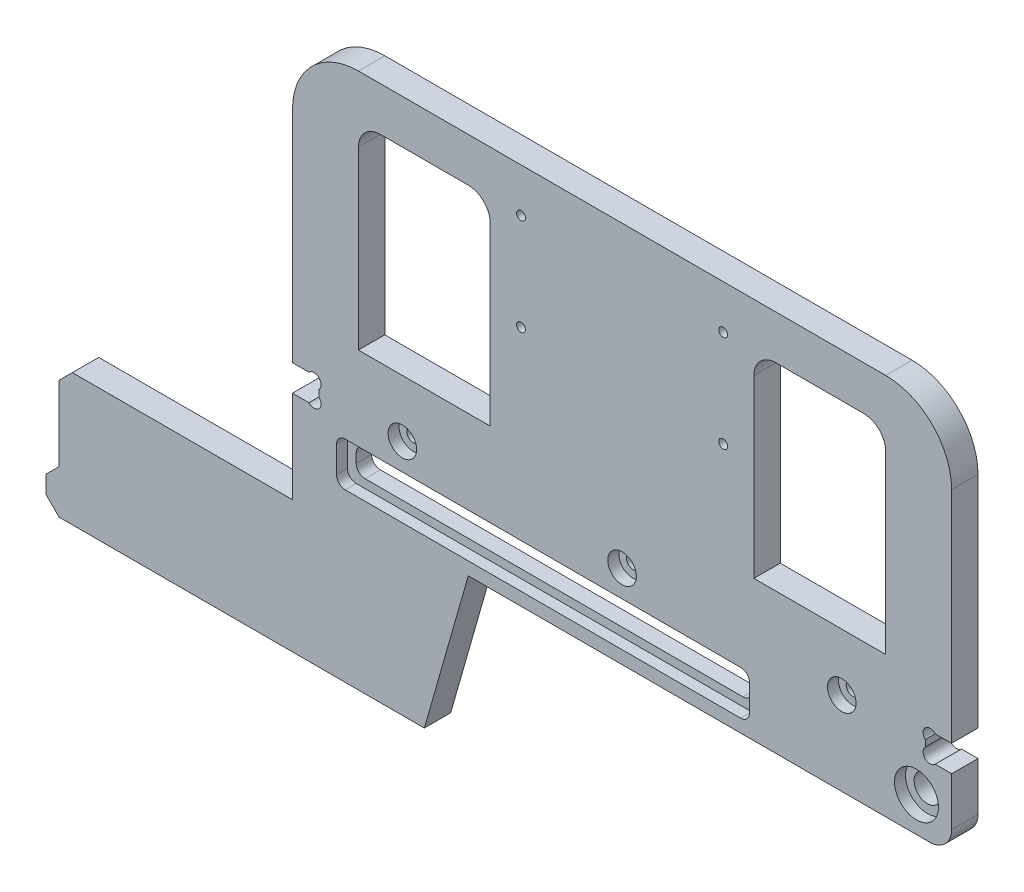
ISO-10303-21;
HEADER;
FILE_DESCRIPTION(('STEP AP214'),'2;1');
FILE_NAME('part.step','',(''),(''),'','','');
FILE_SCHEMA(('AUTOMOTIVE_DESIGN { 1 0 10303 214 1 1 1 1 }'));
ENDSEC;
DATA;
#1=APPLICATION_CONTEXT('core data for automotive mechanical design processes');
#2=APPLICATION_PROTOCOL_DEFINITION('international standard','automotive_design',2000,#1);
#3=PRODUCT_CONTEXT('',#1,'mechanical');
#4=PRODUCT('Part','Part','',(#3));
#5=PRODUCT_RELATED_PRODUCT_CATEGORY('part','',(#4));
#6=PRODUCT_DEFINITION_FORMATION('','',#4);
#7=PRODUCT_DEFINITION_CONTEXT('part definition',#1,'design');
#8=PRODUCT_DEFINITION('design','',#6,#7);
#9=PRODUCT_DEFINITION_SHAPE('','',#8);
#10=(LENGTH_UNIT() NAMED_UNIT(*) SI_UNIT(.MILLI.,.METRE.));
#11=(NAMED_UNIT(*) PLANE_ANGLE_UNIT() SI_UNIT($,.RADIAN.));
#12=(NAMED_UNIT(*) SI_UNIT($,.STERADIAN.) SOLID_ANGLE_UNIT());
#13=UNCERTAINTY_MEASURE_WITH_UNIT(LENGTH_MEASURE(1.E-05),#10,'distance_accuracy_value','');
#14=(GEOMETRIC_REPRESENTATION_CONTEXT(3) GLOBAL_UNCERTAINTY_ASSIGNED_CONTEXT((#13)) GLOBAL_UNIT_ASSIGNED_CONTEXT((#10,
#11,#12)) REPRESENTATION_CONTEXT('',''));
#15=CARTESIAN_POINT('',(0.,0.,0.));
#16=DIRECTION('',(0.,0.,1.));
#17=DIRECTION('',(1.,0.,0.));
#18=AXIS2_PLACEMENT_3D('',#15,#16,#17);
#19=CARTESIAN_POINT('',(-66.3614300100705,-21.8363544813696,0.));
#20=DIRECTION('',(-1.,0.,0.));
#21=DIRECTION('',(0.,0.,1.));
#22=AXIS2_PLACEMENT_3D('',#19,#20,#21);
#23=PLANE('',#22);
#24=DIRECTION('',(0.,1.,0.));
#25=VECTOR('',#24,1.);
#26=CARTESIAN_POINT('',(-66.3614300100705,-21.8363544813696,3.5));
#27=LINE('',#26,#25);
#28=CARTESIAN_POINT('',(-66.3614300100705,-25.9363544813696,3.5));
#29=VERTEX_POINT('',#28);
#30=CARTESIAN_POINT('',(-66.3614300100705,-23.8363544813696,3.5));
#31=VERTEX_POINT('',#30);
#32=EDGE_CURVE('E624',#29,#31,#27,.T.);
#33=ORIENTED_EDGE('',*,*,#32,.F.);
#34=DIRECTION('',(0.,0.,1.));
#35=VECTOR('',#34,1.);
#36=CARTESIAN_POINT('',(-66.3614300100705,-25.9363544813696,0.));
#37=LINE('',#36,#35);
#38=CARTESIAN_POINT('',(-66.3614300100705,-25.9363544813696,0.));
#39=VERTEX_POINT('',#38);
#40=EDGE_CURVE('E719',#29,#39,#37,.F.);
#41=ORIENTED_EDGE('',*,*,#40,.T.);
#42=DIRECTION('',(0.,-1.,0.));
#43=VECTOR('',#42,1.);
#44=CARTESIAN_POINT('',(-66.3614300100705,-21.8363544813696,0.));
#45=LINE('',#44,#43);
#46=CARTESIAN_POINT('',(-66.3614300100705,-23.8363544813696,0.));
#47=VERTEX_POINT('',#46);
#48=EDGE_CURVE('E742',#47,#39,#45,.T.);
#49=ORIENTED_EDGE('',*,*,#48,.F.);
#50=DIRECTION('',(0.,0.,1.));
#51=VECTOR('',#50,1.);
#52=CARTESIAN_POINT('',(-66.3614300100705,-23.8363544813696,6.));
#53=LINE('',#52,#51);
#54=EDGE_CURVE('E721',#47,#31,#53,.T.);
#55=ORIENTED_EDGE('',*,*,#54,.T.);
#56=EDGE_LOOP('',(#33,#41,#49,#55));
#57=FACE_BOUND('',#56,.T.);
#58=ADVANCED_FACE('F34',(#57),#23,.F.);
#59=CARTESIAN_POINT('',(-66.3614300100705,-21.8363544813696,0.));
#60=DIRECTION('',(0.,1.,0.));
#61=DIRECTION('',(-1.,0.,0.));
#62=AXIS2_PLACEMENT_3D('',#59,#60,#61);
#63=PLANE('',#62);
#64=DIRECTION('',(1.,0.,0.));
#65=VECTOR('',#64,1.);
#66=CARTESIAN_POINT('',(-66.3614300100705,-21.8363544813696,3.5));
#67=LINE('',#66,#65);
#68=CARTESIAN_POINT('',(-64.3614300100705,-21.8363544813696,3.5));
#69=VERTEX_POINT('',#68);
#70=CARTESIAN_POINT('',(21.6385699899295,-21.8363544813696,3.5));
#71=VERTEX_POINT('',#70);
#72=EDGE_CURVE('E622',#69,#71,#67,.T.);
#73=ORIENTED_EDGE('',*,*,#72,.F.);
#74=DIRECTION('',(0.,0.,1.));
#75=VECTOR('',#74,1.);
#76=CARTESIAN_POINT('',(-64.3614300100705,-21.8363544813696,0.));
#77=LINE('',#76,#75);
#78=CARTESIAN_POINT('',(-64.3614300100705,-21.8363544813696,0.));
#79=VERTEX_POINT('',#78);
#80=EDGE_CURVE('E727',#69,#79,#77,.F.);
#81=ORIENTED_EDGE('',*,*,#80,.T.);
#82=DIRECTION('',(-1.,0.,0.));
#83=VECTOR('',#82,1.);
#84=CARTESIAN_POINT('',(-66.3614300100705,-21.8363544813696,0.));
#85=LINE('',#84,#83);
#86=CARTESIAN_POINT('',(21.6385699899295,-21.8363544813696,0.));
#87=VERTEX_POINT('',#86);
#88=EDGE_CURVE('E736',#87,#79,#85,.T.);
#89=ORIENTED_EDGE('',*,*,#88,.F.);
#90=DIRECTION('',(0.,0.,1.));
#91=VECTOR('',#90,1.);
#92=CARTESIAN_POINT('',(21.6385699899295,-21.8363544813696,6.));
#93=LINE('',#92,#91);
#94=EDGE_CURVE('E724',#87,#71,#93,.T.);
#95=ORIENTED_EDGE('',*,*,#94,.T.);
#96=EDGE_LOOP('',(#73,#81,#89,#95));
#97=FACE_BOUND('',#96,.T.);
#98=ADVANCED_FACE('F879',(#97),#63,.F.);
#99=CARTESIAN_POINT('',(23.6385699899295,-21.8363544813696,0.));
#100=DIRECTION('',(1.,0.,0.));
#101=DIRECTION('',(0.,0.,-1.));
#102=AXIS2_PLACEMENT_3D('',#99,#100,#101);
#103=PLANE('',#102);
#104=DIRECTION('',(0.,-1.,0.));
#105=VECTOR('',#104,1.);
#106=CARTESIAN_POINT('',(23.6385699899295,-21.8363544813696,3.5));
#107=LINE('',#106,#105);
#108=CARTESIAN_POINT('',(23.6385699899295,-23.8363544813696,3.5));
#109=VERTEX_POINT('',#108);
#110=CARTESIAN_POINT('',(23.6385699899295,-25.9363544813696,3.5));
#111=VERTEX_POINT('',#110);
#112=EDGE_CURVE('E385',#109,#111,#107,.T.);
#113=ORIENTED_EDGE('',*,*,#112,.F.);
#114=DIRECTION('',(0.,0.,1.));
#115=VECTOR('',#114,1.);
#116=CARTESIAN_POINT('',(23.6385699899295,-23.8363544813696,0.));
#117=LINE('',#116,#115);
#118=CARTESIAN_POINT('',(23.6385699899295,-23.8363544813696,0.));
#119=VERTEX_POINT('',#118);
#120=EDGE_CURVE('E406',#109,#119,#117,.F.);
#121=ORIENTED_EDGE('',*,*,#120,.T.);
#122=DIRECTION('',(0.,1.,0.));
#123=VECTOR('',#122,1.);
#124=CARTESIAN_POINT('',(23.6385699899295,-21.8363544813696,0.));
#125=LINE('',#124,#123);
#126=CARTESIAN_POINT('',(23.6385699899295,-25.9363544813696,0.));
#127=VERTEX_POINT('',#126);
#128=EDGE_CURVE('E733',#127,#119,#125,.T.);
#129=ORIENTED_EDGE('',*,*,#128,.F.);
#130=DIRECTION('',(0.,0.,1.));
#131=VECTOR('',#130,1.);
#132=CARTESIAN_POINT('',(23.6385699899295,-25.9363544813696,6.));
#133=LINE('',#132,#131);
#134=EDGE_CURVE('E410',#127,#111,#133,.T.);
#135=ORIENTED_EDGE('',*,*,#134,.T.);
#136=EDGE_LOOP('',(#113,#121,#129,#135));
#137=FACE_BOUND('',#136,.T.);
#138=ADVANCED_FACE('F730',(#137),#103,.F.);
#139=CARTESIAN_POINT('',(-66.3614300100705,-27.9363544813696,0.));
#140=DIRECTION('',(0.,-1.,0.));
#141=DIRECTION('',(0.,0.,-1.));
#142=AXIS2_PLACEMENT_3D('',#139,#140,#141);
#143=PLANE('',#142);
#144=DIRECTION('',(-1.,0.,0.));
#145=VECTOR('',#144,1.);
#146=CARTESIAN_POINT('',(-66.3614300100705,-27.9363544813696,3.5));
#147=LINE('',#146,#145);
#148=CARTESIAN_POINT('',(21.6385699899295,-27.9363544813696,3.5));
#149=VERTEX_POINT('',#148);
#150=CARTESIAN_POINT('',(-64.3614300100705,-27.9363544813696,3.5));
#151=VERTEX_POINT('',#150);
#152=EDGE_CURVE('E382',#149,#151,#147,.T.);
#153=ORIENTED_EDGE('',*,*,#152,.F.);
#154=DIRECTION('',(0.,0.,1.));
#155=VECTOR('',#154,1.);
#156=CARTESIAN_POINT('',(21.6385699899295,-27.9363544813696,0.));
#157=LINE('',#156,#155);
#158=CARTESIAN_POINT('',(21.6385699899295,-27.9363544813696,0.));
#159=VERTEX_POINT('',#158);
#160=EDGE_CURVE('E397',#149,#159,#157,.F.);
#161=ORIENTED_EDGE('',*,*,#160,.T.);
#162=DIRECTION('',(1.,0.,0.));
#163=VECTOR('',#162,1.);
#164=CARTESIAN_POINT('',(-66.3614300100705,-27.9363544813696,0.));
#165=LINE('',#164,#163);
#166=CARTESIAN_POINT('',(-64.3614300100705,-27.9363544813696,0.));
#167=VERTEX_POINT('',#166);
#168=EDGE_CURVE('E737',#167,#159,#165,.T.);
#169=ORIENTED_EDGE('',*,*,#168,.F.);
#170=DIRECTION('',(0.,0.,1.));
#171=VECTOR('',#170,1.);
#172=CARTESIAN_POINT('',(-64.3614300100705,-27.9363544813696,6.));
#173=LINE('',#172,#171);
#174=EDGE_CURVE('E400',#167,#151,#173,.T.);
#175=ORIENTED_EDGE('',*,*,#174,.T.);
#176=EDGE_LOOP('',(#153,#161,#169,#175));
#177=FACE_BOUND('',#176,.T.);
#178=ADVANCED_FACE('F395',(#177),#143,.F.);
#179=CARTESIAN_POINT('',(-64.3614300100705,-23.8363544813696,0.));
#180=DIRECTION('',(0.,0.,-1.));
#181=DIRECTION('',(-1.,0.,0.));
#182=AXIS2_PLACEMENT_3D('',#179,#180,#181);
#183=CYLINDRICAL_SURFACE('',#182,2.);
#184=CARTESIAN_POINT('',(-64.3614300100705,-23.8363544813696,3.5));
#185=DIRECTION('',(0.,0.,1.));
#186=DIRECTION('',(1.,0.,0.));
#187=AXIS2_PLACEMENT_3D('',#184,#185,#186);
#188=CIRCLE('',#187,2.);
#189=EDGE_CURVE('E626',#31,#69,#188,.F.);
#190=ORIENTED_EDGE('',*,*,#189,.F.);
#191=ORIENTED_EDGE('',*,*,#54,.F.);
#192=CARTESIAN_POINT('',(-64.3614300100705,-23.8363544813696,0.));
#193=DIRECTION('',(0.,0.,1.));
#194=DIRECTION('',(1.,0.,0.));
#195=AXIS2_PLACEMENT_3D('',#192,#193,#194);
#196=CIRCLE('',#195,2.);
#197=EDGE_CURVE('E408',#79,#47,#196,.T.);
#198=ORIENTED_EDGE('',*,*,#197,.F.);
#199=ORIENTED_EDGE('',*,*,#80,.F.);
#200=EDGE_LOOP('',(#190,#191,#198,#199));
#201=FACE_BOUND('',#200,.T.);
#202=ADVANCED_FACE('F874',(#201),#183,.F.);
#203=CARTESIAN_POINT('',(21.6385699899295,-23.8363544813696,0.));
#204=DIRECTION('',(0.,0.,-1.));
#205=DIRECTION('',(-1.,0.,0.));
#206=AXIS2_PLACEMENT_3D('',#203,#204,#205);
#207=CYLINDRICAL_SURFACE('',#206,2.);
#208=CARTESIAN_POINT('',(21.6385699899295,-23.8363544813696,3.5));
#209=DIRECTION('',(0.,0.,1.));
#210=DIRECTION('',(1.,0.,0.));
#211=AXIS2_PLACEMENT_3D('',#208,#209,#210);
#212=CIRCLE('',#211,2.);
#213=EDGE_CURVE('E620',#71,#109,#212,.F.);
#214=ORIENTED_EDGE('',*,*,#213,.F.);
#215=ORIENTED_EDGE('',*,*,#94,.F.);
#216=CARTESIAN_POINT('',(21.6385699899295,-23.8363544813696,0.));
#217=DIRECTION('',(0.,0.,1.));
#218=DIRECTION('',(1.,0.,0.));
#219=AXIS2_PLACEMENT_3D('',#216,#217,#218);
#220=CIRCLE('',#219,2.);
#221=EDGE_CURVE('E415',#119,#87,#220,.T.);
#222=ORIENTED_EDGE('',*,*,#221,.F.);
#223=ORIENTED_EDGE('',*,*,#120,.F.);
#224=EDGE_LOOP('',(#214,#215,#222,#223));
#225=FACE_BOUND('',#224,.T.);
#226=ADVANCED_FACE('F883',(#225),#207,.F.);
#227=CARTESIAN_POINT('',(-64.3614300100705,-25.9363544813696,0.));
#228=DIRECTION('',(0.,0.,-1.));
#229=DIRECTION('',(-1.,0.,0.));
#230=AXIS2_PLACEMENT_3D('',#227,#228,#229);
#231=CYLINDRICAL_SURFACE('',#230,2.);
#232=CARTESIAN_POINT('',(-64.3614300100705,-25.9363544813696,3.5));
#233=DIRECTION('',(0.,0.,1.));
#234=DIRECTION('',(1.,0.,0.));
#235=AXIS2_PLACEMENT_3D('',#232,#233,#234);
#236=CIRCLE('',#235,2.);
#237=EDGE_CURVE('E618',#151,#29,#236,.F.);
#238=ORIENTED_EDGE('',*,*,#237,.F.);
#239=ORIENTED_EDGE('',*,*,#174,.F.);
#240=CARTESIAN_POINT('',(-64.3614300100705,-25.9363544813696,0.));
#241=DIRECTION('',(0.,0.,1.));
#242=DIRECTION('',(1.,0.,0.));
#243=AXIS2_PLACEMENT_3D('',#240,#241,#242);
#244=CIRCLE('',#243,2.);
#245=EDGE_CURVE('E417',#39,#167,#244,.T.);
#246=ORIENTED_EDGE('',*,*,#245,.F.);
#247=ORIENTED_EDGE('',*,*,#40,.F.);
#248=EDGE_LOOP('',(#238,#239,#246,#247));
#249=FACE_BOUND('',#248,.T.);
#250=ADVANCED_FACE('F870',(#249),#231,.F.);
#251=CARTESIAN_POINT('',(21.6385699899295,-25.9363544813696,0.));
#252=DIRECTION('',(0.,0.,-1.));
#253=DIRECTION('',(-1.,0.,0.));
#254=AXIS2_PLACEMENT_3D('',#251,#252,#253);
#255=CYLINDRICAL_SURFACE('',#254,2.);
#256=CARTESIAN_POINT('',(21.6385699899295,-25.9363544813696,3.5));
#257=DIRECTION('',(0.,0.,1.));
#258=DIRECTION('',(1.,0.,0.));
#259=AXIS2_PLACEMENT_3D('',#256,#257,#258);
#260=CIRCLE('',#259,2.);
#261=EDGE_CURVE('E379',#111,#149,#260,.F.);
#262=ORIENTED_EDGE('',*,*,#261,.F.);
#263=ORIENTED_EDGE('',*,*,#134,.F.);
#264=CARTESIAN_POINT('',(21.6385699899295,-25.9363544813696,0.));
#265=DIRECTION('',(0.,0.,1.));
#266=DIRECTION('',(1.,0.,0.));
#267=AXIS2_PLACEMENT_3D('',#264,#265,#266);
#268=CIRCLE('',#267,2.);
#269=EDGE_CURVE('E405',#159,#127,#268,.T.);
#270=ORIENTED_EDGE('',*,*,#269,.F.);
#271=ORIENTED_EDGE('',*,*,#160,.F.);
#272=EDGE_LOOP('',(#262,#263,#270,#271));
#273=FACE_BOUND('',#272,.T.);
#274=ADVANCED_FACE('F404',(#273),#255,.F.);
#275=CARTESIAN_POINT('',(-3.36143001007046,-13.8363544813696,0.));
#276=DIRECTION('',(0.,0.,1.));
#277=DIRECTION('',(1.,0.,0.));
#278=AXIS2_PLACEMENT_3D('',#275,#276,#277);
#279=CYLINDRICAL_SURFACE('',#278,1.5);
#280=CARTESIAN_POINT('',(-3.36143001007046,-13.8363544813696,0.));
#281=DIRECTION('',(0.,0.,1.));
#282=DIRECTION('',(1.,0.,0.));
#283=AXIS2_PLACEMENT_3D('',#280,#281,#282);
#284=CIRCLE('',#283,1.5);
#285=CARTESIAN_POINT('',(-1.86143001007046,-13.8363544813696,0.));
#286=VERTEX_POINT('',#285);
#287=EDGE_CURVE('E856',#286,#286,#284,.T.);
#288=ORIENTED_EDGE('',*,*,#287,.F.);
#289=EDGE_LOOP('',(#288));
#290=FACE_BOUND('',#289,.T.);
#291=CARTESIAN_POINT('',(-3.36143001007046,-13.8363544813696,3.5));
#292=DIRECTION('',(0.,0.,1.));
#293=DIRECTION('',(1.,0.,0.));
#294=AXIS2_PLACEMENT_3D('',#291,#292,#293);
#295=CIRCLE('',#294,1.5);
#296=CARTESIAN_POINT('',(-1.86143001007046,-13.8363544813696,3.5));
#297=VERTEX_POINT('',#296);
#298=EDGE_CURVE('E550',#297,#297,#295,.F.);
#299=ORIENTED_EDGE('',*,*,#298,.F.);
#300=EDGE_LOOP('',(#299));
#301=FACE_BOUND('',#300,.T.);
#302=ADVANCED_FACE('F1139',(#290,#301),#279,.F.);
#303=CARTESIAN_POINT('',(46.6385699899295,-13.8363544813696,0.));
#304=DIRECTION('',(0.,0.,1.));
#305=DIRECTION('',(1.,0.,0.));
#306=AXIS2_PLACEMENT_3D('',#303,#304,#305);
#307=CYLINDRICAL_SURFACE('',#306,1.5);
#308=CARTESIAN_POINT('',(46.6385699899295,-13.8363544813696,0.));
#309=DIRECTION('',(0.,0.,1.));
#310=DIRECTION('',(1.,0.,0.));
#311=AXIS2_PLACEMENT_3D('',#308,#309,#310);
#312=CIRCLE('',#311,1.5);
#313=CARTESIAN_POINT('',(48.1385699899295,-13.8363544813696,0.));
#314=VERTEX_POINT('',#313);
#315=EDGE_CURVE('E851',#314,#314,#312,.T.);
#316=ORIENTED_EDGE('',*,*,#315,.F.);
#317=EDGE_LOOP('',(#316));
#318=FACE_BOUND('',#317,.T.);
#319=CARTESIAN_POINT('',(46.6385699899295,-13.8363544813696,3.5));
#320=DIRECTION('',(0.,0.,1.));
#321=DIRECTION('',(1.,0.,0.));
#322=AXIS2_PLACEMENT_3D('',#319,#320,#321);
#323=CIRCLE('',#322,1.5);
#324=CARTESIAN_POINT('',(48.1385699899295,-13.8363544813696,3.5));
#325=VERTEX_POINT('',#324);
#326=EDGE_CURVE('E545',#325,#325,#323,.F.);
#327=ORIENTED_EDGE('',*,*,#326,.F.);
#328=EDGE_LOOP('',(#327));
#329=FACE_BOUND('',#328,.T.);
#330=ADVANCED_FACE('F905',(#318,#329),#307,.F.);
#331=CARTESIAN_POINT('',(63.6385699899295,-24.9363544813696,0.));
#332=DIRECTION('',(0.,0.,1.));
#333=DIRECTION('',(1.,0.,0.));
#334=AXIS2_PLACEMENT_3D('',#331,#332,#333);
#335=CYLINDRICAL_SURFACE('',#334,3.04999999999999);
#336=CARTESIAN_POINT('',(63.6385699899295,-24.9363544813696,0.));
#337=DIRECTION('',(0.,0.,1.));
#338=DIRECTION('',(1.,0.,0.));
#339=AXIS2_PLACEMENT_3D('',#336,#337,#338);
#340=CIRCLE('',#339,3.04999999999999);
#341=CARTESIAN_POINT('',(66.6885699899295,-24.9363544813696,0.));
#342=VERTEX_POINT('',#341);
#343=EDGE_CURVE('E740',#342,#342,#340,.T.);
#344=ORIENTED_EDGE('',*,*,#343,.F.);
#345=EDGE_LOOP('',(#344));
#346=FACE_BOUND('',#345,.T.);
#347=CARTESIAN_POINT('',(63.6385699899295,-24.9363544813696,3.5));
#348=DIRECTION('',(0.,0.,1.));
#349=DIRECTION('',(1.,0.,0.));
#350=AXIS2_PLACEMENT_3D('',#347,#348,#349);
#351=CIRCLE('',#350,3.04999999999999);
#352=CARTESIAN_POINT('',(66.6885699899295,-24.9363544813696,3.5));
#353=VERTEX_POINT('',#352);
#354=EDGE_CURVE('E540',#353,#353,#351,.F.);
#355=ORIENTED_EDGE('',*,*,#354,.F.);
#356=EDGE_LOOP('',(#355));
#357=FACE_BOUND('',#356,.T.);
#358=ADVANCED_FACE('F901',(#346,#357),#335,.F.);
#359=CARTESIAN_POINT('',(-53.3614300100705,-13.8363544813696,0.));
#360=DIRECTION('',(0.,0.,1.));
#361=DIRECTION('',(1.,0.,0.));
#362=AXIS2_PLACEMENT_3D('',#359,#360,#361);
#363=CYLINDRICAL_SURFACE('',#362,1.5);
#364=CARTESIAN_POINT('',(-53.3614300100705,-13.8363544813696,0.));
#365=DIRECTION('',(0.,0.,1.));
#366=DIRECTION('',(1.,0.,0.));
#367=AXIS2_PLACEMENT_3D('',#364,#365,#366);
#368=CIRCLE('',#367,1.5);
#369=CARTESIAN_POINT('',(-51.8614300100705,-13.8363544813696,0.));
#370=VERTEX_POINT('',#369);
#371=EDGE_CURVE('E859',#370,#370,#368,.T.);
#372=ORIENTED_EDGE('',*,*,#371,.F.);
#373=EDGE_LOOP('',(#372));
#374=FACE_BOUND('',#373,.T.);
#375=CARTESIAN_POINT('',(-53.3614300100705,-13.8363544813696,3.5));
#376=DIRECTION('',(0.,0.,1.));
#377=DIRECTION('',(1.,0.,0.));
#378=AXIS2_PLACEMENT_3D('',#375,#376,#377);
#379=CIRCLE('',#378,1.5);
#380=CARTESIAN_POINT('',(-51.8614300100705,-13.8363544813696,3.5));
#381=VERTEX_POINT('',#380);
#382=EDGE_CURVE('E535',#381,#381,#379,.F.);
#383=ORIENTED_EDGE('',*,*,#382,.F.);
#384=EDGE_LOOP('',(#383));
#385=FACE_BOUND('',#384,.T.);
#386=ADVANCED_FACE('F904',(#374,#385),#363,.F.);
#387=CARTESIAN_POINT('',(-78.3614300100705,54.1636455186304,6.));
#388=DIRECTION('',(1.,0.,0.));
#389=DIRECTION('',(0.,1.,0.));
#390=AXIS2_PLACEMENT_3D('',#387,#388,#389);
#391=PLANE('',#390);
#392=DIRECTION('',(0.,0.,-1.));
#393=VECTOR('',#392,1.);
#394=CARTESIAN_POINT('',(-78.3614300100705,-37.8363544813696,6.));
#395=LINE('',#394,#393);
#396=CARTESIAN_POINT('',(-78.3614300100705,-37.8363544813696,6.));
#397=VERTEX_POINT('',#396);
#398=CARTESIAN_POINT('',(-78.3614300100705,-37.8363544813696,0.));
#399=VERTEX_POINT('',#398);
#400=EDGE_CURVE('E505',#397,#399,#395,.T.);
#401=ORIENTED_EDGE('',*,*,#400,.F.);
#402=DIRECTION('',(0.,-1.,0.));
#403=VECTOR('',#402,1.);
#404=CARTESIAN_POINT('',(-78.3614300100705,54.1636455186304,6.));
#405=LINE('',#404,#403);
#406=CARTESIAN_POINT('',(-78.3614300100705,-16.8363544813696,6.));
#407=VERTEX_POINT('',#406);
#408=EDGE_CURVE('E691',#407,#397,#405,.T.);
#409=ORIENTED_EDGE('',*,*,#408,.F.);
#410=DIRECTION('',(0.,0.,-1.));
#411=VECTOR('',#410,1.);
#412=CARTESIAN_POINT('',(-78.3614300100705,-16.8363544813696,6.));
#413=LINE('',#412,#411);
#414=CARTESIAN_POINT('',(-78.3614300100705,-16.8363544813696,0.));
#415=VERTEX_POINT('',#414);
#416=EDGE_CURVE('E793',#407,#415,#413,.T.);
#417=ORIENTED_EDGE('',*,*,#416,.T.);
#418=DIRECTION('',(0.,-1.,0.));
#419=VECTOR('',#418,1.);
#420=CARTESIAN_POINT('',(-78.3614300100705,54.1636455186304,0.));
#421=LINE('',#420,#419);
#422=EDGE_CURVE('E693',#415,#399,#421,.T.);
#423=ORIENTED_EDGE('',*,*,#422,.T.);
#424=EDGE_LOOP('',(#401,#409,#417,#423));
#425=FACE_BOUND('',#424,.T.);
#426=ADVANCED_FACE('F36',(#425),#391,.F.);
#427=CARTESIAN_POINT('',(71.6385699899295,54.1636455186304,6.));
#428=DIRECTION('',(-1.,0.,0.));
#429=DIRECTION('',(0.,-1.,0.));
#430=AXIS2_PLACEMENT_3D('',#427,#428,#429);
#431=PLANE('',#430);
#432=DIRECTION('',(0.,1.,0.));
#433=VECTOR('',#432,1.);
#434=CARTESIAN_POINT('',(71.6385699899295,54.1636455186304,6.));
#435=LINE('',#434,#433);
#436=CARTESIAN_POINT('',(71.6385699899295,-10.8363544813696,6.));
#437=VERTEX_POINT('',#436);
#438=CARTESIAN_POINT('',(71.6385699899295,39.1636455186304,6.));
#439=VERTEX_POINT('',#438);
#440=EDGE_CURVE('E713',#437,#439,#435,.T.);
#441=ORIENTED_EDGE('',*,*,#440,.F.);
#442=DIRECTION('',(0.,0.,-1.));
#443=VECTOR('',#442,1.);
#444=CARTESIAN_POINT('',(71.6385699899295,-10.8363544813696,6.));
#445=LINE('',#444,#443);
#446=CARTESIAN_POINT('',(71.6385699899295,-10.8363544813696,0.));
#447=VERTEX_POINT('',#446);
#448=EDGE_CURVE('E765',#437,#447,#445,.T.);
#449=ORIENTED_EDGE('',*,*,#448,.T.);
#450=DIRECTION('',(0.,1.,0.));
#451=VECTOR('',#450,1.);
#452=CARTESIAN_POINT('',(71.6385699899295,54.1636455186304,0.));
#453=LINE('',#452,#451);
#454=CARTESIAN_POINT('',(71.6385699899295,39.1636455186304,0.));
#455=VERTEX_POINT('',#454);
#456=EDGE_CURVE('E752',#447,#455,#453,.T.);
#457=ORIENTED_EDGE('',*,*,#456,.T.);
#458=DIRECTION('',(0.,0.,-1.));
#459=VECTOR('',#458,1.);
#460=CARTESIAN_POINT('',(71.6385699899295,39.1636455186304,6.));
#461=LINE('',#460,#459);
#462=EDGE_CURVE('E430',#455,#439,#461,.F.);
#463=ORIENTED_EDGE('',*,*,#462,.T.);
#464=EDGE_LOOP('',(#441,#449,#457,#463));
#465=FACE_BOUND('',#464,.T.);
#466=ADVANCED_FACE('F761',(#465),#431,.F.);
#467=CARTESIAN_POINT('',(-78.3614300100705,39.1636455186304,0.));
#468=VERTEX_POINT('',#467);
#469=CARTESIAN_POINT('',(-78.3614300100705,-10.8363544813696,0.));
#470=VERTEX_POINT('',#469);
#471=EDGE_CURVE('E748',#468,#470,#421,.T.);
#472=ORIENTED_EDGE('',*,*,#471,.T.);
#473=DIRECTION('',(0.,0.,-1.));
#474=VECTOR('',#473,1.);
#475=CARTESIAN_POINT('',(-78.3614300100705,-10.8363544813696,6.));
#476=LINE('',#475,#474);
#477=CARTESIAN_POINT('',(-78.3614300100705,-10.8363544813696,6.));
#478=VERTEX_POINT('',#477);
#479=EDGE_CURVE('E788',#478,#470,#476,.T.);
#480=ORIENTED_EDGE('',*,*,#479,.F.);
#481=CARTESIAN_POINT('',(-78.3614300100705,39.1636455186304,6.));
#482=VERTEX_POINT('',#481);
#483=EDGE_CURVE('E702',#482,#478,#405,.T.);
#484=ORIENTED_EDGE('',*,*,#483,.F.);
#485=DIRECTION('',(0.,0.,-1.));
#486=VECTOR('',#485,1.);
#487=CARTESIAN_POINT('',(-78.3614300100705,39.1636455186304,6.));
#488=LINE('',#487,#486);
#489=EDGE_CURVE('E437',#482,#468,#488,.T.);
#490=ORIENTED_EDGE('',*,*,#489,.T.);
#491=EDGE_LOOP('',(#472,#480,#484,#490));
#492=FACE_BOUND('',#491,.T.);
#493=ADVANCED_FACE('F786',(#492),#391,.F.);
#494=CARTESIAN_POINT('',(-78.3614300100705,-32.8363544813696,6.));
#495=DIRECTION('',(0.,1.,0.));
#496=DIRECTION('',(0.,0.,1.));
#497=AXIS2_PLACEMENT_3D('',#494,#495,#496);
#498=PLANE('',#497);
#499=DIRECTION('',(1.,0.,0.));
#500=VECTOR('',#499,1.);
#501=CARTESIAN_POINT('',(-78.3614300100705,-32.8363544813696,6.));
#502=LINE('',#501,#500);
#503=CARTESIAN_POINT('',(-38.3614300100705,-32.8363544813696,6.));
#504=VERTEX_POINT('',#503);
#505=CARTESIAN_POINT('',(66.6385699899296,-32.8363544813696,6.));
#506=VERTEX_POINT('',#505);
#507=EDGE_CURVE('E706',#504,#506,#502,.T.);
#508=ORIENTED_EDGE('',*,*,#507,.F.);
#509=DIRECTION('',(0.,0.,1.));
#510=VECTOR('',#509,1.);
#511=CARTESIAN_POINT('',(-38.3614300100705,-32.8363544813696,0.));
#512=LINE('',#511,#510);
#513=CARTESIAN_POINT('',(-38.3614300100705,-32.8363544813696,0.));
#514=VERTEX_POINT('',#513);
#515=EDGE_CURVE('E924',#514,#504,#512,.T.);
#516=ORIENTED_EDGE('',*,*,#515,.F.);
#517=DIRECTION('',(1.,0.,0.));
#518=VECTOR('',#517,1.);
#519=CARTESIAN_POINT('',(-78.3614300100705,-32.8363544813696,0.));
#520=LINE('',#519,#518);
#521=CARTESIAN_POINT('',(66.6385699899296,-32.8363544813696,0.));
#522=VERTEX_POINT('',#521);
#523=EDGE_CURVE('E751',#514,#522,#520,.T.);
#524=ORIENTED_EDGE('',*,*,#523,.T.);
#525=DIRECTION('',(0.,0.,-1.));
#526=VECTOR('',#525,1.);
#527=CARTESIAN_POINT('',(66.6385699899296,-32.8363544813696,6.));
#528=LINE('',#527,#526);
#529=EDGE_CURVE('E482',#522,#506,#528,.F.);
#530=ORIENTED_EDGE('',*,*,#529,.T.);
#531=EDGE_LOOP('',(#508,#516,#524,#530));
#532=FACE_BOUND('',#531,.T.);
#533=ADVANCED_FACE('F916',(#532),#498,.F.);
#534=CARTESIAN_POINT('',(71.6385699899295,-27.8363544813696,6.));
#535=VERTEX_POINT('',#534);
#536=CARTESIAN_POINT('',(71.6385699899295,-16.8363544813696,6.));
#537=VERTEX_POINT('',#536);
#538=EDGE_CURVE('E714',#535,#537,#435,.T.);
#539=ORIENTED_EDGE('',*,*,#538,.F.);
#540=DIRECTION('',(0.,0.,-1.));
#541=VECTOR('',#540,1.);
#542=CARTESIAN_POINT('',(71.6385699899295,-27.8363544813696,6.));
#543=LINE('',#542,#541);
#544=CARTESIAN_POINT('',(71.6385699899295,-27.8363544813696,0.));
#545=VERTEX_POINT('',#544);
#546=EDGE_CURVE('E476',#535,#545,#543,.T.);
#547=ORIENTED_EDGE('',*,*,#546,.T.);
#548=CARTESIAN_POINT('',(71.6385699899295,-16.8363544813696,0.));
#549=VERTEX_POINT('',#548);
#550=EDGE_CURVE('E708',#545,#549,#453,.T.);
#551=ORIENTED_EDGE('',*,*,#550,.T.);
#552=DIRECTION('',(0.,0.,-1.));
#553=VECTOR('',#552,1.);
#554=CARTESIAN_POINT('',(71.6385699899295,-16.8363544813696,6.));
#555=LINE('',#554,#553);
#556=EDGE_CURVE('E993',#537,#549,#555,.T.);
#557=ORIENTED_EDGE('',*,*,#556,.F.);
#558=EDGE_LOOP('',(#539,#547,#551,#557));
#559=FACE_BOUND('',#558,.T.);
#560=ADVANCED_FACE('F914',(#559),#431,.F.);
#561=CARTESIAN_POINT('',(-78.3614300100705,54.1636455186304,6.));
#562=DIRECTION('',(0.,-1.,0.));
#563=DIRECTION('',(0.,0.,-1.));
#564=AXIS2_PLACEMENT_3D('',#561,#562,#563);
#565=PLANE('',#564);
#566=DIRECTION('',(-1.,0.,0.));
#567=VECTOR('',#566,1.);
#568=CARTESIAN_POINT('',(-78.3614300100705,54.1636455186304,6.));
#569=LINE('',#568,#567);
#570=CARTESIAN_POINT('',(56.6385699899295,54.1636455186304,6.));
#571=VERTEX_POINT('',#570);
#572=CARTESIAN_POINT('',(-63.3614300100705,54.1636455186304,6.));
#573=VERTEX_POINT('',#572);
#574=EDGE_CURVE('E716',#571,#573,#569,.T.);
#575=ORIENTED_EDGE('',*,*,#574,.F.);
#576=DIRECTION('',(0.,0.,-1.));
#577=VECTOR('',#576,1.);
#578=CARTESIAN_POINT('',(56.6385699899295,54.1636455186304,6.));
#579=LINE('',#578,#577);
#580=CARTESIAN_POINT('',(56.6385699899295,54.1636455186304,0.));
#581=VERTEX_POINT('',#580);
#582=EDGE_CURVE('E422',#571,#581,#579,.T.);
#583=ORIENTED_EDGE('',*,*,#582,.T.);
#584=DIRECTION('',(-1.,0.,0.));
#585=VECTOR('',#584,1.);
#586=CARTESIAN_POINT('',(-78.3614300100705,54.1636455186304,0.));
#587=LINE('',#586,#585);
#588=CARTESIAN_POINT('',(-63.3614300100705,54.1636455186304,0.));
#589=VERTEX_POINT('',#588);
#590=EDGE_CURVE('E703',#581,#589,#587,.T.);
#591=ORIENTED_EDGE('',*,*,#590,.T.);
#592=DIRECTION('',(0.,0.,-1.));
#593=VECTOR('',#592,1.);
#594=CARTESIAN_POINT('',(-63.3614300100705,54.1636455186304,6.));
#595=LINE('',#594,#593);
#596=EDGE_CURVE('E420',#589,#573,#595,.F.);
#597=ORIENTED_EDGE('',*,*,#596,.T.);
#598=EDGE_LOOP('',(#575,#583,#591,#597));
#599=FACE_BOUND('',#598,.T.);
#600=ADVANCED_FACE('F777',(#599),#565,.F.);
#601=CARTESIAN_POINT('',(-78.3614300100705,-32.8363544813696,6.));
#602=DIRECTION('',(0.,0.,1.));
#603=DIRECTION('',(1.,0.,0.));
#604=AXIS2_PLACEMENT_3D('',#601,#602,#603);
#605=PLANE('',#604);
#606=DIRECTION('',(0.,-1.,0.));
#607=VECTOR('',#606,1.);
#608=CARTESIAN_POINT('',(-68.3614300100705,-19.8863544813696,6.));
#609=LINE('',#608,#607);
#610=CARTESIAN_POINT('',(-68.3614300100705,-21.8863544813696,6.));
#611=VERTEX_POINT('',#610);
#612=CARTESIAN_POINT('',(-68.3614300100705,-27.8863544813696,6.));
#613=VERTEX_POINT('',#612);
#614=EDGE_CURVE('E589',#611,#613,#609,.T.);
#615=ORIENTED_EDGE('',*,*,#614,.F.);
#616=CARTESIAN_POINT('',(-66.3614300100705,-21.8863544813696,6.));
#617=DIRECTION('',(0.,0.,1.));
#618=DIRECTION('',(1.,0.,0.));
#619=AXIS2_PLACEMENT_3D('',#616,#617,#618);
#620=CIRCLE('',#619,2.);
#621=CARTESIAN_POINT('',(-66.3614300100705,-19.8863544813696,6.));
#622=VERTEX_POINT('',#621);
#623=EDGE_CURVE('E42',#611,#622,#620,.F.);
#624=ORIENTED_EDGE('',*,*,#623,.T.);
#625=DIRECTION('',(-1.,0.,0.));
#626=VECTOR('',#625,1.);
#627=CARTESIAN_POINT('',(-68.3614300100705,-19.8863544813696,6.));
#628=LINE('',#627,#626);
#629=CARTESIAN_POINT('',(23.6385699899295,-19.8863544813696,6.));
#630=VERTEX_POINT('',#629);
#631=EDGE_CURVE('E588',#630,#622,#628,.T.);
#632=ORIENTED_EDGE('',*,*,#631,.F.);
#633=CARTESIAN_POINT('',(23.6385699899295,-21.8863544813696,6.));
#634=DIRECTION('',(0.,0.,1.));
#635=DIRECTION('',(1.,0.,0.));
#636=AXIS2_PLACEMENT_3D('',#633,#634,#635);
#637=CIRCLE('',#636,2.);
#638=CARTESIAN_POINT('',(25.6385699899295,-21.8863544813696,6.));
#639=VERTEX_POINT('',#638);
#640=EDGE_CURVE('E583',#630,#639,#637,.F.);
#641=ORIENTED_EDGE('',*,*,#640,.T.);
#642=DIRECTION('',(0.,1.,0.));
#643=VECTOR('',#642,1.);
#644=CARTESIAN_POINT('',(25.6385699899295,-19.8863544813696,6.));
#645=LINE('',#644,#643);
#646=CARTESIAN_POINT('',(25.6385699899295,-27.8863544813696,6.));
#647=VERTEX_POINT('',#646);
#648=EDGE_CURVE('E596',#647,#639,#645,.T.);
#649=ORIENTED_EDGE('',*,*,#648,.F.);
#650=CARTESIAN_POINT('',(23.6385699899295,-27.8863544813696,6.));
#651=DIRECTION('',(0.,0.,1.));
#652=DIRECTION('',(1.,0.,0.));
#653=AXIS2_PLACEMENT_3D('',#650,#651,#652);
#654=CIRCLE('',#653,2.);
#655=CARTESIAN_POINT('',(23.6385699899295,-29.8863544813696,6.));
#656=VERTEX_POINT('',#655);
#657=EDGE_CURVE('E581',#647,#656,#654,.F.);
#658=ORIENTED_EDGE('',*,*,#657,.T.);
#659=DIRECTION('',(1.,0.,0.));
#660=VECTOR('',#659,1.);
#661=CARTESIAN_POINT('',(-68.3614300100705,-29.8863544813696,6.));
#662=LINE('',#661,#660);
#663=CARTESIAN_POINT('',(-66.3614300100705,-29.8863544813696,6.));
#664=VERTEX_POINT('',#663);
#665=EDGE_CURVE('E1780',#664,#656,#662,.T.);
#666=ORIENTED_EDGE('',*,*,#665,.F.);
#667=CARTESIAN_POINT('',(-66.3614300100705,-27.8863544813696,6.));
#668=DIRECTION('',(0.,0.,1.));
#669=DIRECTION('',(1.,0.,0.));
#670=AXIS2_PLACEMENT_3D('',#667,#668,#669);
#671=CIRCLE('',#670,2.);
#672=EDGE_CURVE('E11',#664,#613,#671,.F.);
#673=ORIENTED_EDGE('',*,*,#672,.T.);
#674=EDGE_LOOP('',(#615,#624,#632,#641,#649,#658,#666,#673));
#675=FACE_BOUND('',#674,.T.);
#676=CARTESIAN_POINT('',(-3.36143001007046,-13.8363544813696,6.));
#677=DIRECTION('',(0.,0.,1.));
#678=DIRECTION('',(1.,0.,0.));
#679=AXIS2_PLACEMENT_3D('',#676,#677,#678);
#680=CIRCLE('',#679,3.25);
#681=CARTESIAN_POINT('',(-0.111430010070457,-13.8363544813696,6.));
#682=VERTEX_POINT('',#681);
#683=EDGE_CURVE('E628',#682,#682,#680,.T.);
#684=ORIENTED_EDGE('',*,*,#683,.F.);
#685=EDGE_LOOP('',(#684));
#686=FACE_BOUND('',#685,.T.);
#687=CARTESIAN_POINT('',(46.6385699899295,-13.8363544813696,6.));
#688=DIRECTION('',(0.,0.,1.));
#689=DIRECTION('',(1.,0.,0.));
#690=AXIS2_PLACEMENT_3D('',#687,#688,#689);
#691=CIRCLE('',#690,3.25);
#692=CARTESIAN_POINT('',(49.8885699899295,-13.8363544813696,6.));
#693=VERTEX_POINT('',#692);
#694=EDGE_CURVE('E552',#693,#693,#691,.T.);
#695=ORIENTED_EDGE('',*,*,#694,.F.);
#696=EDGE_LOOP('',(#695));
#697=FACE_BOUND('',#696,.T.);
#698=CARTESIAN_POINT('',(63.6385699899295,-24.9363544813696,6.));
#699=DIRECTION('',(0.,0.,1.));
#700=DIRECTION('',(1.,0.,0.));
#701=AXIS2_PLACEMENT_3D('',#698,#699,#700);
#702=CIRCLE('',#701,5.);
#703=CARTESIAN_POINT('',(68.6385699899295,-24.9363544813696,6.));
#704=VERTEX_POINT('',#703);
#705=EDGE_CURVE('E548',#704,#704,#702,.T.);
#706=ORIENTED_EDGE('',*,*,#705,.F.);
#707=EDGE_LOOP('',(#706));
#708=FACE_BOUND('',#707,.T.);
#709=CARTESIAN_POINT('',(-53.3614300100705,-13.8363544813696,6.));
#710=DIRECTION('',(0.,0.,1.));
#711=DIRECTION('',(1.,0.,0.));
#712=AXIS2_PLACEMENT_3D('',#709,#710,#711);
#713=CIRCLE('',#712,3.25);
#714=CARTESIAN_POINT('',(-50.1114300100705,-13.8363544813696,6.));
#715=VERTEX_POINT('',#714);
#716=EDGE_CURVE('E543',#715,#715,#713,.T.);
#717=ORIENTED_EDGE('',*,*,#716,.F.);
#718=EDGE_LOOP('',(#717));
#719=FACE_BOUND('',#718,.T.);
#720=CARTESIAN_POINT('',(19.6385699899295,22.1636455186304,6.));
#721=DIRECTION('',(0.,0.,1.));
#722=DIRECTION('',(1.,0.,0.));
#723=AXIS2_PLACEMENT_3D('',#720,#721,#722);
#724=CIRCLE('',#723,1.);
#725=CARTESIAN_POINT('',(20.6385699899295,22.1636455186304,6.));
#726=VERTEX_POINT('',#725);
#727=EDGE_CURVE('E538',#726,#726,#724,.T.);
#728=ORIENTED_EDGE('',*,*,#727,.F.);
#729=EDGE_LOOP('',(#728));
#730=FACE_BOUND('',#729,.T.);
#731=CARTESIAN_POINT('',(-26.3614300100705,22.1636455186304,6.));
#732=DIRECTION('',(0.,0.,1.));
#733=DIRECTION('',(1.,0.,0.));
#734=AXIS2_PLACEMENT_3D('',#731,#732,#733);
#735=CIRCLE('',#734,1.);
#736=CARTESIAN_POINT('',(-25.3614300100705,22.1636455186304,6.));
#737=VERTEX_POINT('',#736);
#738=EDGE_CURVE('E650',#737,#737,#735,.T.);
#739=ORIENTED_EDGE('',*,*,#738,.F.);
#740=EDGE_LOOP('',(#739));
#741=FACE_BOUND('',#740,.T.);
#742=CARTESIAN_POINT('',(19.6385699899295,44.1636455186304,6.));
#743=DIRECTION('',(0.,0.,1.));
#744=DIRECTION('',(1.,0.,0.));
#745=AXIS2_PLACEMENT_3D('',#742,#743,#744);
#746=CIRCLE('',#745,1.);
#747=CARTESIAN_POINT('',(20.6385699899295,44.1636455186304,6.));
#748=VERTEX_POINT('',#747);
#749=EDGE_CURVE('E656',#748,#748,#746,.T.);
#750=ORIENTED_EDGE('',*,*,#749,.F.);
#751=EDGE_LOOP('',(#750));
#752=FACE_BOUND('',#751,.T.);
#753=CARTESIAN_POINT('',(-26.3614300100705,44.1636455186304,6.));
#754=DIRECTION('',(0.,0.,1.));
#755=DIRECTION('',(1.,0.,0.));
#756=AXIS2_PLACEMENT_3D('',#753,#754,#755);
#757=CIRCLE('',#756,1.);
#758=CARTESIAN_POINT('',(-25.3614300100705,44.1636455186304,6.));
#759=VERTEX_POINT('',#758);
#760=EDGE_CURVE('E662',#759,#759,#757,.T.);
#761=ORIENTED_EDGE('',*,*,#760,.F.);
#762=EDGE_LOOP('',(#761));
#763=FACE_BOUND('',#762,.T.);
#764=DIRECTION('',(0.,1.,0.));
#765=VECTOR('',#764,1.);
#766=CARTESIAN_POINT('',(-134.46143001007,-67.8363544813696,6.));
#767=LINE('',#766,#765);
#768=CARTESIAN_POINT('',(-134.46143001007,-64.8363544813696,6.));
#769=VERTEX_POINT('',#768);
#770=CARTESIAN_POINT('',(-134.46143001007,-60.8363544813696,6.));
#771=VERTEX_POINT('',#770);
#772=EDGE_CURVE('E669',#769,#771,#767,.T.);
#773=ORIENTED_EDGE('',*,*,#772,.F.);
#774=DIRECTION('',(-0.707106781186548,0.707106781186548,0.));
#775=VECTOR('',#774,1.);
#776=CARTESIAN_POINT('',(-122.41143001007,-76.8863544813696,6.));
#777=LINE('',#776,#775);
#778=CARTESIAN_POINT('',(-131.46143001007,-67.8363544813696,6.));
#779=VERTEX_POINT('',#778);
#780=EDGE_CURVE('E1032',#769,#779,#777,.F.);
#781=ORIENTED_EDGE('',*,*,#780,.T.);
#782=DIRECTION('',(1.,0.,0.));
#783=VECTOR('',#782,1.);
#784=CARTESIAN_POINT('',(-78.3614300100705,-67.8363544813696,6.));
#785=LINE('',#784,#783);
#786=CARTESIAN_POINT('',(-48.3614300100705,-67.8363544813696,6.));
#787=VERTEX_POINT('',#786);
#788=EDGE_CURVE('E940',#779,#787,#785,.T.);
#789=ORIENTED_EDGE('',*,*,#788,.T.);
#790=DIRECTION('',(0.274721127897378,0.961523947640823,0.));
#791=VECTOR('',#790,1.);
#792=CARTESIAN_POINT('',(-48.3614300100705,-67.8363544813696,6.));
#793=LINE('',#792,#791);
#794=EDGE_CURVE('E933',#787,#504,#793,.T.);
#795=ORIENTED_EDGE('',*,*,#794,.T.);
#796=ORIENTED_EDGE('',*,*,#507,.T.);
#797=CARTESIAN_POINT('',(66.6385699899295,-27.8363544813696,6.));
#798=DIRECTION('',(0.,0.,1.));
#799=DIRECTION('',(1.,0.,0.));
#800=AXIS2_PLACEMENT_3D('',#797,#798,#799);
#801=CIRCLE('',#800,5.);
#802=EDGE_CURVE('E485',#506,#535,#801,.T.);
#803=ORIENTED_EDGE('',*,*,#802,.T.);
#804=ORIENTED_EDGE('',*,*,#538,.T.);
#805=DIRECTION('',(-1.,0.,0.));
#806=VECTOR('',#805,1.);
#807=CARTESIAN_POINT('',(71.6385699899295,-16.8363544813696,6.));
#808=LINE('',#807,#806);
#809=CARTESIAN_POINT('',(67.9004649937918,-16.8363544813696,6.));
#810=VERTEX_POINT('',#809);
#811=EDGE_CURVE('E986',#537,#810,#808,.T.);
#812=ORIENTED_EDGE('',*,*,#811,.T.);
#813=CARTESIAN_POINT('',(66.7385699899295,-15.7363544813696,6.));
#814=DIRECTION('',(0.,0.,-1.));
#815=DIRECTION('',(-1.,0.,0.));
#816=AXIS2_PLACEMENT_3D('',#813,#814,#815);
#817=CIRCLE('',#816,1.6);
#818=CARTESIAN_POINT('',(65.6385699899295,-14.5744594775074,6.));
#819=VERTEX_POINT('',#818);
#820=EDGE_CURVE('E965',#810,#819,#817,.T.);
#821=ORIENTED_EDGE('',*,*,#820,.T.);
#822=DIRECTION('',(0.,1.,0.));
#823=VECTOR('',#822,1.);
#824=CARTESIAN_POINT('',(65.6385699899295,-10.8363544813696,6.));
#825=LINE('',#824,#823);
#826=CARTESIAN_POINT('',(65.6385699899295,-13.0982494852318,6.));
#827=VERTEX_POINT('',#826);
#828=EDGE_CURVE('E989',#819,#827,#825,.T.);
#829=ORIENTED_EDGE('',*,*,#828,.T.);
#830=CARTESIAN_POINT('',(66.7385699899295,-11.9363544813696,6.));
#831=DIRECTION('',(0.,0.,-1.));
#832=DIRECTION('',(-1.,0.,0.));
#833=AXIS2_PLACEMENT_3D('',#830,#831,#832);
#834=CIRCLE('',#833,1.6);
#835=CARTESIAN_POINT('',(67.9004649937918,-10.8363544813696,6.));
#836=VERTEX_POINT('',#835);
#837=EDGE_CURVE('E973',#827,#836,#834,.T.);
#838=ORIENTED_EDGE('',*,*,#837,.T.);
#839=DIRECTION('',(1.,0.,0.));
#840=VECTOR('',#839,1.);
#841=CARTESIAN_POINT('',(71.6385699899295,-10.8363544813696,6.));
#842=LINE('',#841,#840);
#843=EDGE_CURVE('E991',#836,#437,#842,.T.);
#844=ORIENTED_EDGE('',*,*,#843,.T.);
#845=ORIENTED_EDGE('',*,*,#440,.T.);
#846=CARTESIAN_POINT('',(56.6385699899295,39.1636455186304,6.));
#847=DIRECTION('',(0.,0.,1.));
#848=DIRECTION('',(1.,0.,0.));
#849=AXIS2_PLACEMENT_3D('',#846,#847,#848);
#850=CIRCLE('',#849,15.);
#851=EDGE_CURVE('E435',#439,#571,#850,.T.);
#852=ORIENTED_EDGE('',*,*,#851,.T.);
#853=ORIENTED_EDGE('',*,*,#574,.T.);
#854=CARTESIAN_POINT('',(-63.3614300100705,39.1636455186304,6.));
#855=DIRECTION('',(0.,0.,1.));
#856=DIRECTION('',(1.,0.,0.));
#857=AXIS2_PLACEMENT_3D('',#854,#855,#856);
#858=CIRCLE('',#857,15.);
#859=EDGE_CURVE('E433',#573,#482,#858,.T.);
#860=ORIENTED_EDGE('',*,*,#859,.T.);
#861=ORIENTED_EDGE('',*,*,#483,.T.);
#862=DIRECTION('',(1.,0.,0.));
#863=VECTOR('',#862,1.);
#864=CARTESIAN_POINT('',(-72.3614300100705,-10.8363544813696,6.));
#865=LINE('',#864,#863);
#866=CARTESIAN_POINT('',(-74.6233250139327,-10.8363544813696,6.));
#867=VERTEX_POINT('',#866);
#868=EDGE_CURVE('E797',#478,#867,#865,.T.);
#869=ORIENTED_EDGE('',*,*,#868,.T.);
#870=CARTESIAN_POINT('',(-73.4614300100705,-11.9363544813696,6.));
#871=DIRECTION('',(0.,0.,-1.));
#872=DIRECTION('',(-1.,0.,0.));
#873=AXIS2_PLACEMENT_3D('',#870,#871,#872);
#874=CIRCLE('',#873,1.6);
#875=CARTESIAN_POINT('',(-72.3614300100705,-13.0982494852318,6.));
#876=VERTEX_POINT('',#875);
#877=EDGE_CURVE('E957',#867,#876,#874,.T.);
#878=ORIENTED_EDGE('',*,*,#877,.T.);
#879=DIRECTION('',(0.,-1.,0.));
#880=VECTOR('',#879,1.);
#881=CARTESIAN_POINT('',(-72.3614300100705,-16.8363544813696,6.));
#882=LINE('',#881,#880);
#883=CARTESIAN_POINT('',(-72.3614300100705,-14.5744594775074,6.));
#884=VERTEX_POINT('',#883);
#885=EDGE_CURVE('E1003',#876,#884,#882,.T.);
#886=ORIENTED_EDGE('',*,*,#885,.T.);
#887=CARTESIAN_POINT('',(-73.4614300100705,-15.7363544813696,6.));
#888=DIRECTION('',(0.,0.,-1.));
#889=DIRECTION('',(-1.,0.,0.));
#890=AXIS2_PLACEMENT_3D('',#887,#888,#889);
#891=CIRCLE('',#890,1.6);
#892=CARTESIAN_POINT('',(-74.6233250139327,-16.8363544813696,6.));
#893=VERTEX_POINT('',#892);
#894=EDGE_CURVE('E950',#884,#893,#891,.T.);
#895=ORIENTED_EDGE('',*,*,#894,.T.);
#896=DIRECTION('',(-1.,0.,0.));
#897=VECTOR('',#896,1.);
#898=CARTESIAN_POINT('',(-72.3614300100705,-16.8363544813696,6.));
#899=LINE('',#898,#897);
#900=EDGE_CURVE('E700',#893,#407,#899,.T.);
#901=ORIENTED_EDGE('',*,*,#900,.T.);
#902=ORIENTED_EDGE('',*,*,#408,.T.);
#903=DIRECTION('',(1.,0.,0.));
#904=VECTOR('',#903,1.);
#905=CARTESIAN_POINT('',(-131.46143001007,-37.8363544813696,6.));
#906=LINE('',#905,#904);
#907=CARTESIAN_POINT('',(-128.461430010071,-37.8363544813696,6.));
#908=VERTEX_POINT('',#907);
#909=EDGE_CURVE('E685',#908,#397,#906,.T.);
#910=ORIENTED_EDGE('',*,*,#909,.F.);
#911=DIRECTION('',(-0.707106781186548,-0.707106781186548,0.));
#912=VECTOR('',#911,1.);
#913=CARTESIAN_POINT('',(-100.91143001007,-10.2863544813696,6.));
#914=LINE('',#913,#912);
#915=CARTESIAN_POINT('',(-131.461430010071,-40.8363544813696,6.));
#916=VERTEX_POINT('',#915);
#917=EDGE_CURVE('E1028',#908,#916,#914,.T.);
#918=ORIENTED_EDGE('',*,*,#917,.T.);
#919=DIRECTION('',(0.,1.,0.));
#920=VECTOR('',#919,1.);
#921=CARTESIAN_POINT('',(-131.46143001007,-67.8363544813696,6.));
#922=LINE('',#921,#920);
#923=CARTESIAN_POINT('',(-131.46143001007,-57.8363544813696,6.));
#924=VERTEX_POINT('',#923);
#925=EDGE_CURVE('E500',#924,#916,#922,.T.);
#926=ORIENTED_EDGE('',*,*,#925,.F.);
#927=DIRECTION('',(-0.707106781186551,-0.707106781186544,0.));
#928=VECTOR('',#927,1.);
#929=CARTESIAN_POINT('',(-92.4114300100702,-18.7863544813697,6.));
#930=LINE('',#929,#928);
#931=EDGE_CURVE('E1027',#924,#771,#930,.T.);
#932=ORIENTED_EDGE('',*,*,#931,.T.);
#933=EDGE_LOOP('',(#773,#781,#789,#795,#796,#803,#804,#812,#821,#829,#838,#844,#845,#852,#853,
#860,#861,#869,#878,#886,#895,#901,#902,#910,#918,#926,#932));
#934=FACE_BOUND('',#933,.T.);
#935=DIRECTION('',(1.,0.,0.));
#936=VECTOR('',#935,1.);
#937=CARTESIAN_POINT('',(-33.3614300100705,44.1636455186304,6.));
#938=LINE('',#937,#936);
#939=CARTESIAN_POINT('',(-58.3614300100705,44.1636455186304,6.));
#940=VERTEX_POINT('',#939);
#941=CARTESIAN_POINT('',(-38.3614300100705,44.1636455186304,6.));
#942=VERTEX_POINT('',#941);
#943=EDGE_CURVE('E818',#940,#942,#938,.T.);
#944=ORIENTED_EDGE('',*,*,#943,.T.);
#945=CARTESIAN_POINT('',(-38.3614300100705,39.1636455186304,6.));
#946=DIRECTION('',(0.,0.,1.));
#947=DIRECTION('',(1.,0.,0.));
#948=AXIS2_PLACEMENT_3D('',#945,#946,#947);
#949=CIRCLE('',#948,5.);
#950=CARTESIAN_POINT('',(-33.3614300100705,39.1636455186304,6.));
#951=VERTEX_POINT('',#950);
#952=EDGE_CURVE('E470',#942,#951,#949,.F.);
#953=ORIENTED_EDGE('',*,*,#952,.T.);
#954=DIRECTION('',(0.,-1.,0.));
#955=VECTOR('',#954,1.);
#956=CARTESIAN_POINT('',(-33.3614300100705,44.1636455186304,6.));
#957=LINE('',#956,#955);
#958=CARTESIAN_POINT('',(-33.3614300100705,-0.836354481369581,6.));
#959=VERTEX_POINT('',#958);
#960=EDGE_CURVE('E810',#951,#959,#957,.T.);
#961=ORIENTED_EDGE('',*,*,#960,.T.);
#962=DIRECTION('',(-1.,0.,0.));
#963=VECTOR('',#962,1.);
#964=CARTESIAN_POINT('',(-33.3614300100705,-0.836354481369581,6.));
#965=LINE('',#964,#963);
#966=CARTESIAN_POINT('',(-63.3614300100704,-0.836354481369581,6.));
#967=VERTEX_POINT('',#966);
#968=EDGE_CURVE('E812',#959,#967,#965,.T.);
#969=ORIENTED_EDGE('',*,*,#968,.T.);
#970=DIRECTION('',(0.,1.,0.));
#971=VECTOR('',#970,1.);
#972=CARTESIAN_POINT('',(-63.3614300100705,44.1636455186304,6.));
#973=LINE('',#972,#971);
#974=CARTESIAN_POINT('',(-63.3614300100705,39.1636455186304,6.));
#975=VERTEX_POINT('',#974);
#976=EDGE_CURVE('E815',#967,#975,#973,.T.);
#977=ORIENTED_EDGE('',*,*,#976,.T.);
#978=CARTESIAN_POINT('',(-58.3614300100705,39.1636455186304,6.));
#979=DIRECTION('',(0.,0.,1.));
#980=DIRECTION('',(1.,0.,0.));
#981=AXIS2_PLACEMENT_3D('',#978,#979,#980);
#982=CIRCLE('',#981,5.);
#983=EDGE_CURVE('E462',#975,#940,#982,.F.);
#984=ORIENTED_EDGE('',*,*,#983,.T.);
#985=EDGE_LOOP('',(#944,#953,#961,#969,#977,#984));
#986=FACE_BOUND('',#985,.T.);
#987=DIRECTION('',(1.,0.,0.));
#988=VECTOR('',#987,1.);
#989=CARTESIAN_POINT('',(56.6385699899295,44.1636455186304,6.));
#990=LINE('',#989,#988);
#991=CARTESIAN_POINT('',(31.6385699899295,44.1636455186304,6.));
#992=VERTEX_POINT('',#991);
#993=CARTESIAN_POINT('',(51.6385699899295,44.1636455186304,6.));
#994=VERTEX_POINT('',#993);
#995=EDGE_CURVE('E845',#992,#994,#990,.T.);
#996=ORIENTED_EDGE('',*,*,#995,.T.);
#997=CARTESIAN_POINT('',(51.6385699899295,39.1636455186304,6.));
#998=DIRECTION('',(0.,0.,1.));
#999=DIRECTION('',(1.,0.,0.));
#1000=AXIS2_PLACEMENT_3D('',#997,#998,#999);
#1001=CIRCLE('',#1000,5.);
#1002=CARTESIAN_POINT('',(56.6385699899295,39.1636455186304,6.));
#1003=VERTEX_POINT('',#1002);
#1004=EDGE_CURVE('E474',#994,#1003,#1001,.F.);
#1005=ORIENTED_EDGE('',*,*,#1004,.T.);
#1006=DIRECTION('',(0.,-1.,0.));
#1007=VECTOR('',#1006,1.);
#1008=CARTESIAN_POINT('',(56.6385699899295,44.1636455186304,6.));
#1009=LINE('',#1008,#1007);
#1010=CARTESIAN_POINT('',(56.6385699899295,-0.836354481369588,6.));
#1011=VERTEX_POINT('',#1010);
#1012=EDGE_CURVE('E837',#1003,#1011,#1009,.T.);
#1013=ORIENTED_EDGE('',*,*,#1012,.T.);
#1014=DIRECTION('',(-1.,0.,0.));
#1015=VECTOR('',#1014,1.);
#1016=CARTESIAN_POINT('',(56.6385699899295,-0.836354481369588,6.));
#1017=LINE('',#1016,#1015);
#1018=CARTESIAN_POINT('',(26.6385699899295,-0.836354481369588,6.));
#1019=VERTEX_POINT('',#1018);
#1020=EDGE_CURVE('E839',#1011,#1019,#1017,.T.);
#1021=ORIENTED_EDGE('',*,*,#1020,.T.);
#1022=DIRECTION('',(0.,1.,0.));
#1023=VECTOR('',#1022,1.);
#1024=CARTESIAN_POINT('',(26.6385699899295,44.1636455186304,6.));
#1025=LINE('',#1024,#1023);
#1026=CARTESIAN_POINT('',(26.6385699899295,39.1636455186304,6.));
#1027=VERTEX_POINT('',#1026);
#1028=EDGE_CURVE('E842',#1019,#1027,#1025,.T.);
#1029=ORIENTED_EDGE('',*,*,#1028,.T.);
#1030=CARTESIAN_POINT('',(31.6385699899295,39.1636455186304,6.));
#1031=DIRECTION('',(0.,0.,1.));
#1032=DIRECTION('',(1.,0.,0.));
#1033=AXIS2_PLACEMENT_3D('',#1030,#1031,#1032);
#1034=CIRCLE('',#1033,5.);
#1035=EDGE_CURVE('E466',#1027,#992,#1034,.F.);
#1036=ORIENTED_EDGE('',*,*,#1035,.T.);
#1037=EDGE_LOOP('',(#996,#1005,#1013,#1021,#1029,#1036));
#1038=FACE_BOUND('',#1037,.T.);
#1039=ADVANCED_FACE('F586',(#675,#686,#697,#708,#719,#730,#741,#752,#763,#934,#986,#1038),#605,.T.);
#1040=CARTESIAN_POINT('',(-78.3614300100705,-32.8363544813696,0.));
#1041=DIRECTION('',(0.,0.,1.));
#1042=DIRECTION('',(1.,0.,0.));
#1043=AXIS2_PLACEMENT_3D('',#1040,#1041,#1042);
#1044=PLANE('',#1043);
#1045=CARTESIAN_POINT('',(19.6385699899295,22.1636455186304,0.));
#1046=DIRECTION('',(0.,0.,1.));
#1047=DIRECTION('',(1.,0.,0.));
#1048=AXIS2_PLACEMENT_3D('',#1045,#1046,#1047);
#1049=CIRCLE('',#1048,1.);
#1050=CARTESIAN_POINT('',(20.6385699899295,22.1636455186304,0.));
#1051=VERTEX_POINT('',#1050);
#1052=EDGE_CURVE('E647',#1051,#1051,#1049,.T.);
#1053=ORIENTED_EDGE('',*,*,#1052,.T.);
#1054=EDGE_LOOP('',(#1053));
#1055=FACE_BOUND('',#1054,.T.);
#1056=CARTESIAN_POINT('',(-26.3614300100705,22.1636455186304,0.));
#1057=DIRECTION('',(0.,0.,1.));
#1058=DIRECTION('',(1.,0.,0.));
#1059=AXIS2_PLACEMENT_3D('',#1056,#1057,#1058);
#1060=CIRCLE('',#1059,1.);
#1061=CARTESIAN_POINT('',(-25.3614300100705,22.1636455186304,0.));
#1062=VERTEX_POINT('',#1061);
#1063=EDGE_CURVE('E653',#1062,#1062,#1060,.T.);
#1064=ORIENTED_EDGE('',*,*,#1063,.T.);
#1065=EDGE_LOOP('',(#1064));
#1066=FACE_BOUND('',#1065,.T.);
#1067=CARTESIAN_POINT('',(19.6385699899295,44.1636455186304,0.));
#1068=DIRECTION('',(0.,0.,1.));
#1069=DIRECTION('',(1.,0.,0.));
#1070=AXIS2_PLACEMENT_3D('',#1067,#1068,#1069);
#1071=CIRCLE('',#1070,1.);
#1072=CARTESIAN_POINT('',(20.6385699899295,44.1636455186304,0.));
#1073=VERTEX_POINT('',#1072);
#1074=EDGE_CURVE('E659',#1073,#1073,#1071,.T.);
#1075=ORIENTED_EDGE('',*,*,#1074,.T.);
#1076=EDGE_LOOP('',(#1075));
#1077=FACE_BOUND('',#1076,.T.);
#1078=CARTESIAN_POINT('',(-26.3614300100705,44.1636455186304,0.));
#1079=DIRECTION('',(0.,0.,1.));
#1080=DIRECTION('',(1.,0.,0.));
#1081=AXIS2_PLACEMENT_3D('',#1078,#1079,#1080);
#1082=CIRCLE('',#1081,1.);
#1083=CARTESIAN_POINT('',(-25.3614300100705,44.1636455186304,0.));
#1084=VERTEX_POINT('',#1083);
#1085=EDGE_CURVE('E665',#1084,#1084,#1082,.T.);
#1086=ORIENTED_EDGE('',*,*,#1085,.T.);
#1087=EDGE_LOOP('',(#1086));
#1088=FACE_BOUND('',#1087,.T.);
#1089=DIRECTION('',(-1.,0.,0.));
#1090=VECTOR('',#1089,1.);
#1091=CARTESIAN_POINT('',(-33.3614300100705,-0.836354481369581,0.));
#1092=LINE('',#1091,#1090);
#1093=CARTESIAN_POINT('',(-33.3614300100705,-0.836354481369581,0.));
#1094=VERTEX_POINT('',#1093);
#1095=CARTESIAN_POINT('',(-63.3614300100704,-0.836354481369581,0.));
#1096=VERTEX_POINT('',#1095);
#1097=EDGE_CURVE('E795',#1094,#1096,#1092,.T.);
#1098=ORIENTED_EDGE('',*,*,#1097,.F.);
#1099=DIRECTION('',(0.,-1.,0.));
#1100=VECTOR('',#1099,1.);
#1101=CARTESIAN_POINT('',(-33.3614300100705,44.1636455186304,0.));
#1102=LINE('',#1101,#1100);
#1103=CARTESIAN_POINT('',(-33.3614300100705,39.1636455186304,0.));
#1104=VERTEX_POINT('',#1103);
#1105=EDGE_CURVE('E792',#1104,#1094,#1102,.T.);
#1106=ORIENTED_EDGE('',*,*,#1105,.F.);
#1107=CARTESIAN_POINT('',(-38.3614300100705,39.1636455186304,0.));
#1108=DIRECTION('',(0.,0.,1.));
#1109=DIRECTION('',(1.,0.,0.));
#1110=AXIS2_PLACEMENT_3D('',#1107,#1108,#1109);
#1111=CIRCLE('',#1110,5.);
#1112=CARTESIAN_POINT('',(-38.3614300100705,44.1636455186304,0.));
#1113=VERTEX_POINT('',#1112);
#1114=EDGE_CURVE('E468',#1104,#1113,#1111,.T.);
#1115=ORIENTED_EDGE('',*,*,#1114,.T.);
#1116=DIRECTION('',(1.,0.,0.));
#1117=VECTOR('',#1116,1.);
#1118=CARTESIAN_POINT('',(-33.3614300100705,44.1636455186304,0.));
#1119=LINE('',#1118,#1117);
#1120=CARTESIAN_POINT('',(-58.3614300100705,44.1636455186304,0.));
#1121=VERTEX_POINT('',#1120);
#1122=EDGE_CURVE('E807',#1121,#1113,#1119,.T.);
#1123=ORIENTED_EDGE('',*,*,#1122,.F.);
#1124=CARTESIAN_POINT('',(-58.3614300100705,39.1636455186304,0.));
#1125=DIRECTION('',(0.,0.,1.));
#1126=DIRECTION('',(1.,0.,0.));
#1127=AXIS2_PLACEMENT_3D('',#1124,#1125,#1126);
#1128=CIRCLE('',#1127,5.);
#1129=CARTESIAN_POINT('',(-63.3614300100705,39.1636455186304,0.));
#1130=VERTEX_POINT('',#1129);
#1131=EDGE_CURVE('E460',#1121,#1130,#1128,.T.);
#1132=ORIENTED_EDGE('',*,*,#1131,.T.);
#1133=DIRECTION('',(0.,1.,0.));
#1134=VECTOR('',#1133,1.);
#1135=CARTESIAN_POINT('',(-63.3614300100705,44.1636455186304,0.));
#1136=LINE('',#1135,#1134);
#1137=EDGE_CURVE('E804',#1096,#1130,#1136,.T.);
#1138=ORIENTED_EDGE('',*,*,#1137,.F.);
#1139=EDGE_LOOP('',(#1098,#1106,#1115,#1123,#1132,#1138));
#1140=FACE_BOUND('',#1139,.T.);
#1141=DIRECTION('',(-1.,0.,0.));
#1142=VECTOR('',#1141,1.);
#1143=CARTESIAN_POINT('',(56.6385699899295,-0.836354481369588,0.));
#1144=LINE('',#1143,#1142);
#1145=CARTESIAN_POINT('',(56.6385699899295,-0.836354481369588,0.));
#1146=VERTEX_POINT('',#1145);
#1147=CARTESIAN_POINT('',(26.6385699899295,-0.836354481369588,0.));
#1148=VERTEX_POINT('',#1147);
#1149=EDGE_CURVE('E828',#1146,#1148,#1144,.T.);
#1150=ORIENTED_EDGE('',*,*,#1149,.F.);
#1151=DIRECTION('',(0.,-1.,0.));
#1152=VECTOR('',#1151,1.);
#1153=CARTESIAN_POINT('',(56.6385699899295,44.1636455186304,0.));
#1154=LINE('',#1153,#1152);
#1155=CARTESIAN_POINT('',(56.6385699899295,39.1636455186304,0.));
#1156=VERTEX_POINT('',#1155);
#1157=EDGE_CURVE('E824',#1156,#1146,#1154,.T.);
#1158=ORIENTED_EDGE('',*,*,#1157,.F.);
#1159=CARTESIAN_POINT('',(51.6385699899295,39.1636455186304,0.));
#1160=DIRECTION('',(0.,0.,1.));
#1161=DIRECTION('',(1.,0.,0.));
#1162=AXIS2_PLACEMENT_3D('',#1159,#1160,#1161);
#1163=CIRCLE('',#1162,5.);
#1164=CARTESIAN_POINT('',(51.6385699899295,44.1636455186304,0.));
#1165=VERTEX_POINT('',#1164);
#1166=EDGE_CURVE('E472',#1156,#1165,#1163,.T.);
#1167=ORIENTED_EDGE('',*,*,#1166,.T.);
#1168=DIRECTION('',(1.,0.,0.));
#1169=VECTOR('',#1168,1.);
#1170=CARTESIAN_POINT('',(56.6385699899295,44.1636455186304,0.));
#1171=LINE('',#1170,#1169);
#1172=CARTESIAN_POINT('',(31.6385699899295,44.1636455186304,0.));
#1173=VERTEX_POINT('',#1172);
#1174=EDGE_CURVE('E834',#1173,#1165,#1171,.T.);
#1175=ORIENTED_EDGE('',*,*,#1174,.F.);
#1176=CARTESIAN_POINT('',(31.6385699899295,39.1636455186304,0.));
#1177=DIRECTION('',(0.,0.,1.));
#1178=DIRECTION('',(1.,0.,0.));
#1179=AXIS2_PLACEMENT_3D('',#1176,#1177,#1178);
#1180=CIRCLE('',#1179,5.);
#1181=CARTESIAN_POINT('',(26.6385699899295,39.1636455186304,0.));
#1182=VERTEX_POINT('',#1181);
#1183=EDGE_CURVE('E464',#1173,#1182,#1180,.T.);
#1184=ORIENTED_EDGE('',*,*,#1183,.T.);
#1185=DIRECTION('',(0.,1.,0.));
#1186=VECTOR('',#1185,1.);
#1187=CARTESIAN_POINT('',(26.6385699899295,44.1636455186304,0.));
#1188=LINE('',#1187,#1186);
#1189=EDGE_CURVE('E831',#1148,#1182,#1188,.T.);
#1190=ORIENTED_EDGE('',*,*,#1189,.F.);
#1191=EDGE_LOOP('',(#1150,#1158,#1167,#1175,#1184,#1190));
#1192=FACE_BOUND('',#1191,.T.);
#1193=ORIENTED_EDGE('',*,*,#315,.T.);
#1194=EDGE_LOOP('',(#1193));
#1195=FACE_BOUND('',#1194,.T.);
#1196=ORIENTED_EDGE('',*,*,#287,.T.);
#1197=EDGE_LOOP('',(#1196));
#1198=FACE_BOUND('',#1197,.T.);
#1199=ORIENTED_EDGE('',*,*,#371,.T.);
#1200=EDGE_LOOP('',(#1199));
#1201=FACE_BOUND('',#1200,.T.);
#1202=ORIENTED_EDGE('',*,*,#128,.T.);
#1203=ORIENTED_EDGE('',*,*,#221,.T.);
#1204=ORIENTED_EDGE('',*,*,#88,.T.);
#1205=ORIENTED_EDGE('',*,*,#197,.T.);
#1206=ORIENTED_EDGE('',*,*,#48,.T.);
#1207=ORIENTED_EDGE('',*,*,#245,.T.);
#1208=ORIENTED_EDGE('',*,*,#168,.T.);
#1209=ORIENTED_EDGE('',*,*,#269,.T.);
#1210=EDGE_LOOP('',(#1202,#1203,#1204,#1205,#1206,#1207,#1208,#1209));
#1211=FACE_BOUND('',#1210,.T.);
#1212=ORIENTED_EDGE('',*,*,#343,.T.);
#1213=EDGE_LOOP('',(#1212));
#1214=FACE_BOUND('',#1213,.T.);
#1215=DIRECTION('',(1.,0.,0.));
#1216=VECTOR('',#1215,1.);
#1217=CARTESIAN_POINT('',(-78.3614300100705,-67.8363544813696,0.));
#1218=LINE('',#1217,#1216);
#1219=CARTESIAN_POINT('',(-131.46143001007,-67.8363544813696,0.));
#1220=VERTEX_POINT('',#1219);
#1221=CARTESIAN_POINT('',(-48.3614300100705,-67.8363544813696,0.));
#1222=VERTEX_POINT('',#1221);
#1223=EDGE_CURVE('E942',#1220,#1222,#1218,.T.);
#1224=ORIENTED_EDGE('',*,*,#1223,.F.);
#1225=DIRECTION('',(0.707106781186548,-0.707106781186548,0.));
#1226=VECTOR('',#1225,1.);
#1227=CARTESIAN_POINT('',(-134.46143001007,-64.8363544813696,0.));
#1228=LINE('',#1227,#1226);
#1229=CARTESIAN_POINT('',(-134.46143001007,-64.8363544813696,0.));
#1230=VERTEX_POINT('',#1229);
#1231=EDGE_CURVE('E527',#1220,#1230,#1228,.F.);
#1232=ORIENTED_EDGE('',*,*,#1231,.T.);
#1233=DIRECTION('',(0.,-1.,0.));
#1234=VECTOR('',#1233,1.);
#1235=CARTESIAN_POINT('',(-134.46143001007,-67.8363544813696,0.));
#1236=LINE('',#1235,#1234);
#1237=CARTESIAN_POINT('',(-134.46143001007,-60.8363544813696,0.));
#1238=VERTEX_POINT('',#1237);
#1239=EDGE_CURVE('E671',#1238,#1230,#1236,.T.);
#1240=ORIENTED_EDGE('',*,*,#1239,.F.);
#1241=DIRECTION('',(0.707106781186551,0.707106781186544,0.));
#1242=VECTOR('',#1241,1.);
#1243=CARTESIAN_POINT('',(-134.46143001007,-60.8363544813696,0.));
#1244=LINE('',#1243,#1242);
#1245=CARTESIAN_POINT('',(-131.46143001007,-57.8363544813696,0.));
#1246=VERTEX_POINT('',#1245);
#1247=EDGE_CURVE('E525',#1238,#1246,#1244,.T.);
#1248=ORIENTED_EDGE('',*,*,#1247,.T.);
#1249=DIRECTION('',(0.,-1.,0.));
#1250=VECTOR('',#1249,1.);
#1251=CARTESIAN_POINT('',(-131.46143001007,-67.8363544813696,0.));
#1252=LINE('',#1251,#1250);
#1253=CARTESIAN_POINT('',(-131.46143001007,-40.8363544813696,0.));
#1254=VERTEX_POINT('',#1253);
#1255=EDGE_CURVE('E504',#1254,#1246,#1252,.T.);
#1256=ORIENTED_EDGE('',*,*,#1255,.F.);
#1257=DIRECTION('',(0.707106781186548,0.707106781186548,0.));
#1258=VECTOR('',#1257,1.);
#1259=CARTESIAN_POINT('',(-131.46143001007,-40.8363544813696,0.));
#1260=LINE('',#1259,#1258);
#1261=CARTESIAN_POINT('',(-128.461430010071,-37.8363544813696,0.));
#1262=VERTEX_POINT('',#1261);
#1263=EDGE_CURVE('E523',#1254,#1262,#1260,.T.);
#1264=ORIENTED_EDGE('',*,*,#1263,.T.);
#1265=DIRECTION('',(1.,0.,0.));
#1266=VECTOR('',#1265,1.);
#1267=CARTESIAN_POINT('',(-131.46143001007,-37.8363544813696,0.));
#1268=LINE('',#1267,#1266);
#1269=EDGE_CURVE('E515',#1262,#399,#1268,.T.);
#1270=ORIENTED_EDGE('',*,*,#1269,.T.);
#1271=ORIENTED_EDGE('',*,*,#422,.F.);
#1272=DIRECTION('',(-1.,0.,0.));
#1273=VECTOR('',#1272,1.);
#1274=CARTESIAN_POINT('',(-72.3614300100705,-16.8363544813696,0.));
#1275=LINE('',#1274,#1273);
#1276=CARTESIAN_POINT('',(-74.6233250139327,-16.8363544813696,0.));
#1277=VERTEX_POINT('',#1276);
#1278=EDGE_CURVE('E999',#1277,#415,#1275,.T.);
#1279=ORIENTED_EDGE('',*,*,#1278,.F.);
#1280=CARTESIAN_POINT('',(-73.4614300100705,-15.7363544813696,0.));
#1281=DIRECTION('',(0.,0.,-1.));
#1282=DIRECTION('',(-1.,0.,0.));
#1283=AXIS2_PLACEMENT_3D('',#1280,#1281,#1282);
#1284=CIRCLE('',#1283,1.6);
#1285=CARTESIAN_POINT('',(-72.3614300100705,-14.5744594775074,0.));
#1286=VERTEX_POINT('',#1285);
#1287=EDGE_CURVE('E936',#1286,#1277,#1284,.T.);
#1288=ORIENTED_EDGE('',*,*,#1287,.F.);
#1289=DIRECTION('',(0.,-1.,0.));
#1290=VECTOR('',#1289,1.);
#1291=CARTESIAN_POINT('',(-72.3614300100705,-16.8363544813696,0.));
#1292=LINE('',#1291,#1290);
#1293=CARTESIAN_POINT('',(-72.3614300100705,-13.0982494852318,0.));
#1294=VERTEX_POINT('',#1293);
#1295=EDGE_CURVE('E995',#1294,#1286,#1292,.T.);
#1296=ORIENTED_EDGE('',*,*,#1295,.F.);
#1297=CARTESIAN_POINT('',(-73.4614300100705,-11.9363544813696,0.));
#1298=DIRECTION('',(0.,0.,-1.));
#1299=DIRECTION('',(-1.,0.,0.));
#1300=AXIS2_PLACEMENT_3D('',#1297,#1298,#1299);
#1301=CIRCLE('',#1300,1.6);
#1302=CARTESIAN_POINT('',(-74.6233250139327,-10.8363544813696,0.));
#1303=VERTEX_POINT('',#1302);
#1304=EDGE_CURVE('E955',#1303,#1294,#1301,.T.);
#1305=ORIENTED_EDGE('',*,*,#1304,.F.);
#1306=DIRECTION('',(1.,0.,0.));
#1307=VECTOR('',#1306,1.);
#1308=CARTESIAN_POINT('',(-72.3614300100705,-10.8363544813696,0.));
#1309=LINE('',#1308,#1307);
#1310=EDGE_CURVE('E1001',#470,#1303,#1309,.T.);
#1311=ORIENTED_EDGE('',*,*,#1310,.F.);
#1312=ORIENTED_EDGE('',*,*,#471,.F.);
#1313=CARTESIAN_POINT('',(-63.3614300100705,39.1636455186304,0.));
#1314=DIRECTION('',(0.,0.,1.));
#1315=DIRECTION('',(1.,0.,0.));
#1316=AXIS2_PLACEMENT_3D('',#1313,#1314,#1315);
#1317=CIRCLE('',#1316,15.);
#1318=EDGE_CURVE('E425',#468,#589,#1317,.F.);
#1319=ORIENTED_EDGE('',*,*,#1318,.T.);
#1320=ORIENTED_EDGE('',*,*,#590,.F.);
#1321=CARTESIAN_POINT('',(56.6385699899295,39.1636455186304,0.));
#1322=DIRECTION('',(0.,0.,1.));
#1323=DIRECTION('',(1.,0.,0.));
#1324=AXIS2_PLACEMENT_3D('',#1321,#1322,#1323);
#1325=CIRCLE('',#1324,15.);
#1326=EDGE_CURVE('E427',#581,#455,#1325,.F.);
#1327=ORIENTED_EDGE('',*,*,#1326,.T.);
#1328=ORIENTED_EDGE('',*,*,#456,.F.);
#1329=DIRECTION('',(1.,0.,0.));
#1330=VECTOR('',#1329,1.);
#1331=CARTESIAN_POINT('',(71.6385699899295,-10.8363544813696,0.));
#1332=LINE('',#1331,#1330);
#1333=CARTESIAN_POINT('',(67.9004649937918,-10.8363544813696,0.));
#1334=VERTEX_POINT('',#1333);
#1335=EDGE_CURVE('E984',#1334,#447,#1332,.T.);
#1336=ORIENTED_EDGE('',*,*,#1335,.F.);
#1337=CARTESIAN_POINT('',(66.7385699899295,-11.9363544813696,0.));
#1338=DIRECTION('',(0.,0.,-1.));
#1339=DIRECTION('',(-1.,0.,0.));
#1340=AXIS2_PLACEMENT_3D('',#1337,#1338,#1339);
#1341=CIRCLE('',#1340,1.6);
#1342=CARTESIAN_POINT('',(65.6385699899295,-13.0982494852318,0.));
#1343=VERTEX_POINT('',#1342);
#1344=EDGE_CURVE('E971',#1343,#1334,#1341,.T.);
#1345=ORIENTED_EDGE('',*,*,#1344,.F.);
#1346=DIRECTION('',(0.,1.,0.));
#1347=VECTOR('',#1346,1.);
#1348=CARTESIAN_POINT('',(65.6385699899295,-10.8363544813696,0.));
#1349=LINE('',#1348,#1347);
#1350=CARTESIAN_POINT('',(65.6385699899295,-14.5744594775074,0.));
#1351=VERTEX_POINT('',#1350);
#1352=EDGE_CURVE('E982',#1351,#1343,#1349,.T.);
#1353=ORIENTED_EDGE('',*,*,#1352,.F.);
#1354=CARTESIAN_POINT('',(66.7385699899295,-15.7363544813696,0.));
#1355=DIRECTION('',(0.,0.,-1.));
#1356=DIRECTION('',(-1.,0.,0.));
#1357=AXIS2_PLACEMENT_3D('',#1354,#1355,#1356);
#1358=CIRCLE('',#1357,1.6);
#1359=CARTESIAN_POINT('',(67.9004649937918,-16.8363544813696,0.));
#1360=VERTEX_POINT('',#1359);
#1361=EDGE_CURVE('E963',#1360,#1351,#1358,.T.);
#1362=ORIENTED_EDGE('',*,*,#1361,.F.);
#1363=DIRECTION('',(-1.,0.,0.));
#1364=VECTOR('',#1363,1.);
#1365=CARTESIAN_POINT('',(71.6385699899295,-16.8363544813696,0.));
#1366=LINE('',#1365,#1364);
#1367=EDGE_CURVE('E979',#549,#1360,#1366,.T.);
#1368=ORIENTED_EDGE('',*,*,#1367,.F.);
#1369=ORIENTED_EDGE('',*,*,#550,.F.);
#1370=CARTESIAN_POINT('',(66.6385699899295,-27.8363544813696,0.));
#1371=DIRECTION('',(0.,0.,1.));
#1372=DIRECTION('',(1.,0.,0.));
#1373=AXIS2_PLACEMENT_3D('',#1370,#1371,#1372);
#1374=CIRCLE('',#1373,5.);
#1375=EDGE_CURVE('E479',#545,#522,#1374,.F.);
#1376=ORIENTED_EDGE('',*,*,#1375,.T.);
#1377=ORIENTED_EDGE('',*,*,#523,.F.);
#1378=DIRECTION('',(0.274721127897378,0.961523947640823,0.));
#1379=VECTOR('',#1378,1.);
#1380=CARTESIAN_POINT('',(-48.3614300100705,-67.8363544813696,0.));
#1381=LINE('',#1380,#1379);
#1382=EDGE_CURVE('E935',#1222,#514,#1381,.T.);
#1383=ORIENTED_EDGE('',*,*,#1382,.F.);
#1384=EDGE_LOOP('',(#1224,#1232,#1240,#1248,#1256,#1264,#1270,#1271,#1279,#1288,#1296,#1305,
#1311,#1312,#1319,#1320,#1327,#1328,#1336,#1345,#1353,#1362,#1368,#1369,#1376,#1377,#1383));
#1385=FACE_BOUND('',#1384,.T.);
#1386=ADVANCED_FACE('F770',(#1055,#1066,#1077,#1088,#1140,#1192,#1195,#1198,#1201,#1211,#1214,
#1385),#1044,.F.);
#1387=CARTESIAN_POINT('',(56.6385699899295,39.1636455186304,6.));
#1388=DIRECTION('',(0.,0.,-1.));
#1389=DIRECTION('',(-1.,0.,0.));
#1390=AXIS2_PLACEMENT_3D('',#1387,#1388,#1389);
#1391=CYLINDRICAL_SURFACE('',#1390,15.);
#1392=ORIENTED_EDGE('',*,*,#851,.F.);
#1393=ORIENTED_EDGE('',*,*,#462,.F.);
#1394=ORIENTED_EDGE('',*,*,#1326,.F.);
#1395=ORIENTED_EDGE('',*,*,#582,.F.);
#1396=EDGE_LOOP('',(#1392,#1393,#1394,#1395));
#1397=FACE_BOUND('',#1396,.T.);
#1398=ADVANCED_FACE('F773',(#1397),#1391,.T.);
#1399=CARTESIAN_POINT('',(-63.3614300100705,39.1636455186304,6.));
#1400=DIRECTION('',(0.,0.,-1.));
#1401=DIRECTION('',(-1.,0.,0.));
#1402=AXIS2_PLACEMENT_3D('',#1399,#1400,#1401);
#1403=CYLINDRICAL_SURFACE('',#1402,15.);
#1404=ORIENTED_EDGE('',*,*,#859,.F.);
#1405=ORIENTED_EDGE('',*,*,#596,.F.);
#1406=ORIENTED_EDGE('',*,*,#1318,.F.);
#1407=ORIENTED_EDGE('',*,*,#489,.F.);
#1408=EDGE_LOOP('',(#1404,#1405,#1406,#1407));
#1409=FACE_BOUND('',#1408,.T.);
#1410=ADVANCED_FACE('F780',(#1409),#1403,.T.);
#1411=CARTESIAN_POINT('',(56.6385699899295,44.1636455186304,6.));
#1412=DIRECTION('',(1.,0.,0.));
#1413=DIRECTION('',(0.,0.,-1.));
#1414=AXIS2_PLACEMENT_3D('',#1411,#1412,#1413);
#1415=PLANE('',#1414);
#1416=ORIENTED_EDGE('',*,*,#1012,.F.);
#1417=DIRECTION('',(0.,0.,-1.));
#1418=VECTOR('',#1417,1.);
#1419=CARTESIAN_POINT('',(56.6385699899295,39.1636455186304,0.));
#1420=LINE('',#1419,#1418);
#1421=EDGE_CURVE('E457',#1003,#1156,#1420,.T.);
#1422=ORIENTED_EDGE('',*,*,#1421,.T.);
#1423=ORIENTED_EDGE('',*,*,#1157,.T.);
#1424=DIRECTION('',(0.,0.,-1.));
#1425=VECTOR('',#1424,1.);
#1426=CARTESIAN_POINT('',(56.6385699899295,-0.836354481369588,6.));
#1427=LINE('',#1426,#1425);
#1428=EDGE_CURVE('E848',#1011,#1146,#1427,.T.);
#1429=ORIENTED_EDGE('',*,*,#1428,.F.);
#1430=EDGE_LOOP('',(#1416,#1422,#1423,#1429));
#1431=FACE_BOUND('',#1430,.T.);
#1432=ADVANCED_FACE('F1123',(#1431),#1415,.F.);
#1433=CARTESIAN_POINT('',(56.6385699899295,44.1636455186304,6.));
#1434=DIRECTION('',(0.,1.,0.));
#1435=DIRECTION('',(0.,0.,1.));
#1436=AXIS2_PLACEMENT_3D('',#1433,#1434,#1435);
#1437=PLANE('',#1436);
#1438=ORIENTED_EDGE('',*,*,#995,.F.);
#1439=DIRECTION('',(0.,0.,-1.));
#1440=VECTOR('',#1439,1.);
#1441=CARTESIAN_POINT('',(31.6385699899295,44.1636455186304,0.));
#1442=LINE('',#1441,#1440);
#1443=EDGE_CURVE('E449',#992,#1173,#1442,.T.);
#1444=ORIENTED_EDGE('',*,*,#1443,.T.);
#1445=ORIENTED_EDGE('',*,*,#1174,.T.);
#1446=DIRECTION('',(0.,0.,-1.));
#1447=VECTOR('',#1446,1.);
#1448=CARTESIAN_POINT('',(51.6385699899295,44.1636455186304,6.));
#1449=LINE('',#1448,#1447);
#1450=EDGE_CURVE('E447',#1165,#994,#1449,.F.);
#1451=ORIENTED_EDGE('',*,*,#1450,.T.);
#1452=EDGE_LOOP('',(#1438,#1444,#1445,#1451));
#1453=FACE_BOUND('',#1452,.T.);
#1454=ADVANCED_FACE('F1119',(#1453),#1437,.F.);
#1455=CARTESIAN_POINT('',(26.6385699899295,44.1636455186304,6.));
#1456=DIRECTION('',(-1.,0.,0.));
#1457=DIRECTION('',(0.,-1.,0.));
#1458=AXIS2_PLACEMENT_3D('',#1455,#1456,#1457);
#1459=PLANE('',#1458);
#1460=ORIENTED_EDGE('',*,*,#1189,.T.);
#1461=DIRECTION('',(0.,0.,-1.));
#1462=VECTOR('',#1461,1.);
#1463=CARTESIAN_POINT('',(26.6385699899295,39.1636455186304,6.));
#1464=LINE('',#1463,#1462);
#1465=EDGE_CURVE('E452',#1182,#1027,#1464,.F.);
#1466=ORIENTED_EDGE('',*,*,#1465,.T.);
#1467=ORIENTED_EDGE('',*,*,#1028,.F.);
#1468=DIRECTION('',(0.,0.,-1.));
#1469=VECTOR('',#1468,1.);
#1470=CARTESIAN_POINT('',(26.6385699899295,-0.836354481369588,6.));
#1471=LINE('',#1470,#1469);
#1472=EDGE_CURVE('E849',#1019,#1148,#1471,.T.);
#1473=ORIENTED_EDGE('',*,*,#1472,.T.);
#1474=EDGE_LOOP('',(#1460,#1466,#1467,#1473));
#1475=FACE_BOUND('',#1474,.T.);
#1476=ADVANCED_FACE('F1122',(#1475),#1459,.F.);
#1477=CARTESIAN_POINT('',(56.6385699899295,-0.836354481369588,6.));
#1478=DIRECTION('',(0.,-1.,0.));
#1479=DIRECTION('',(0.,0.,-1.));
#1480=AXIS2_PLACEMENT_3D('',#1477,#1478,#1479);
#1481=PLANE('',#1480);
#1482=ORIENTED_EDGE('',*,*,#1149,.T.);
#1483=ORIENTED_EDGE('',*,*,#1472,.F.);
#1484=ORIENTED_EDGE('',*,*,#1020,.F.);
#1485=ORIENTED_EDGE('',*,*,#1428,.T.);
#1486=EDGE_LOOP('',(#1482,#1483,#1484,#1485));
#1487=FACE_BOUND('',#1486,.T.);
#1488=ADVANCED_FACE('F1117',(#1487),#1481,.F.);
#1489=CARTESIAN_POINT('',(-33.3614300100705,44.1636455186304,6.));
#1490=DIRECTION('',(1.,0.,0.));
#1491=DIRECTION('',(0.,0.,-1.));
#1492=AXIS2_PLACEMENT_3D('',#1489,#1490,#1491);
#1493=PLANE('',#1492);
#1494=ORIENTED_EDGE('',*,*,#960,.F.);
#1495=DIRECTION('',(0.,0.,-1.));
#1496=VECTOR('',#1495,1.);
#1497=CARTESIAN_POINT('',(-33.3614300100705,39.1636455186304,0.));
#1498=LINE('',#1497,#1496);
#1499=EDGE_CURVE('E454',#951,#1104,#1498,.T.);
#1500=ORIENTED_EDGE('',*,*,#1499,.T.);
#1501=ORIENTED_EDGE('',*,*,#1105,.T.);
#1502=DIRECTION('',(0.,0.,-1.));
#1503=VECTOR('',#1502,1.);
#1504=CARTESIAN_POINT('',(-33.3614300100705,-0.836354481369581,6.));
#1505=LINE('',#1504,#1503);
#1506=EDGE_CURVE('E821',#959,#1094,#1505,.T.);
#1507=ORIENTED_EDGE('',*,*,#1506,.F.);
#1508=EDGE_LOOP('',(#1494,#1500,#1501,#1507));
#1509=FACE_BOUND('',#1508,.T.);
#1510=ADVANCED_FACE('F1107',(#1509),#1493,.F.);
#1511=CARTESIAN_POINT('',(-33.3614300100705,44.1636455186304,6.));
#1512=DIRECTION('',(0.,1.,0.));
#1513=DIRECTION('',(-1.,0.,0.));
#1514=AXIS2_PLACEMENT_3D('',#1511,#1512,#1513);
#1515=PLANE('',#1514);
#1516=ORIENTED_EDGE('',*,*,#943,.F.);
#1517=DIRECTION('',(0.,0.,-1.));
#1518=VECTOR('',#1517,1.);
#1519=CARTESIAN_POINT('',(-58.3614300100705,44.1636455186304,0.));
#1520=LINE('',#1519,#1518);
#1521=EDGE_CURVE('E442',#940,#1121,#1520,.T.);
#1522=ORIENTED_EDGE('',*,*,#1521,.T.);
#1523=ORIENTED_EDGE('',*,*,#1122,.T.);
#1524=DIRECTION('',(0.,0.,-1.));
#1525=VECTOR('',#1524,1.);
#1526=CARTESIAN_POINT('',(-38.3614300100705,44.1636455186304,6.));
#1527=LINE('',#1526,#1525);
#1528=EDGE_CURVE('E440',#1113,#942,#1527,.F.);
#1529=ORIENTED_EDGE('',*,*,#1528,.T.);
#1530=EDGE_LOOP('',(#1516,#1522,#1523,#1529));
#1531=FACE_BOUND('',#1530,.T.);
#1532=ADVANCED_FACE('F1103',(#1531),#1515,.F.);
#1533=CARTESIAN_POINT('',(-63.3614300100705,44.1636455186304,6.));
#1534=DIRECTION('',(-1.,0.,0.));
#1535=DIRECTION('',(0.,-1.,0.));
#1536=AXIS2_PLACEMENT_3D('',#1533,#1534,#1535);
#1537=PLANE('',#1536);
#1538=ORIENTED_EDGE('',*,*,#1137,.T.);
#1539=DIRECTION('',(0.,0.,-1.));
#1540=VECTOR('',#1539,1.);
#1541=CARTESIAN_POINT('',(-63.3614300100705,39.1636455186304,6.));
#1542=LINE('',#1541,#1540);
#1543=EDGE_CURVE('E445',#1130,#975,#1542,.F.);
#1544=ORIENTED_EDGE('',*,*,#1543,.T.);
#1545=ORIENTED_EDGE('',*,*,#976,.F.);
#1546=DIRECTION('',(0.,0.,-1.));
#1547=VECTOR('',#1546,1.);
#1548=CARTESIAN_POINT('',(-63.3614300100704,-0.836354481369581,6.));
#1549=LINE('',#1548,#1547);
#1550=EDGE_CURVE('E822',#967,#1096,#1549,.T.);
#1551=ORIENTED_EDGE('',*,*,#1550,.T.);
#1552=EDGE_LOOP('',(#1538,#1544,#1545,#1551));
#1553=FACE_BOUND('',#1552,.T.);
#1554=ADVANCED_FACE('F1106',(#1553),#1537,.F.);
#1555=CARTESIAN_POINT('',(-33.3614300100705,-0.836354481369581,6.));
#1556=DIRECTION('',(0.,-1.,0.));
#1557=DIRECTION('',(0.,0.,-1.));
#1558=AXIS2_PLACEMENT_3D('',#1555,#1556,#1557);
#1559=PLANE('',#1558);
#1560=ORIENTED_EDGE('',*,*,#1097,.T.);
#1561=ORIENTED_EDGE('',*,*,#1550,.F.);
#1562=ORIENTED_EDGE('',*,*,#968,.F.);
#1563=ORIENTED_EDGE('',*,*,#1506,.T.);
#1564=EDGE_LOOP('',(#1560,#1561,#1562,#1563));
#1565=FACE_BOUND('',#1564,.T.);
#1566=ADVANCED_FACE('F1101',(#1565),#1559,.F.);
#1567=CARTESIAN_POINT('',(-58.3614300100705,39.1636455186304,6.));
#1568=DIRECTION('',(0.,0.,1.));
#1569=DIRECTION('',(1.,0.,0.));
#1570=AXIS2_PLACEMENT_3D('',#1567,#1568,#1569);
#1571=CYLINDRICAL_SURFACE('',#1570,5.);
#1572=ORIENTED_EDGE('',*,*,#983,.F.);
#1573=ORIENTED_EDGE('',*,*,#1543,.F.);
#1574=ORIENTED_EDGE('',*,*,#1131,.F.);
#1575=ORIENTED_EDGE('',*,*,#1521,.F.);
#1576=EDGE_LOOP('',(#1572,#1573,#1574,#1575));
#1577=FACE_BOUND('',#1576,.T.);
#1578=ADVANCED_FACE('F1097',(#1577),#1571,.F.);
#1579=CARTESIAN_POINT('',(31.6385699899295,39.1636455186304,6.));
#1580=DIRECTION('',(0.,0.,1.));
#1581=DIRECTION('',(1.,0.,0.));
#1582=AXIS2_PLACEMENT_3D('',#1579,#1580,#1581);
#1583=CYLINDRICAL_SURFACE('',#1582,5.);
#1584=ORIENTED_EDGE('',*,*,#1035,.F.);
#1585=ORIENTED_EDGE('',*,*,#1465,.F.);
#1586=ORIENTED_EDGE('',*,*,#1183,.F.);
#1587=ORIENTED_EDGE('',*,*,#1443,.F.);
#1588=EDGE_LOOP('',(#1584,#1585,#1586,#1587));
#1589=FACE_BOUND('',#1588,.T.);
#1590=ADVANCED_FACE('F1093',(#1589),#1583,.F.);
#1591=CARTESIAN_POINT('',(-38.3614300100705,39.1636455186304,6.));
#1592=DIRECTION('',(0.,0.,1.));
#1593=DIRECTION('',(1.,0.,0.));
#1594=AXIS2_PLACEMENT_3D('',#1591,#1592,#1593);
#1595=CYLINDRICAL_SURFACE('',#1594,5.);
#1596=ORIENTED_EDGE('',*,*,#952,.F.);
#1597=ORIENTED_EDGE('',*,*,#1528,.F.);
#1598=ORIENTED_EDGE('',*,*,#1114,.F.);
#1599=ORIENTED_EDGE('',*,*,#1499,.F.);
#1600=EDGE_LOOP('',(#1596,#1597,#1598,#1599));
#1601=FACE_BOUND('',#1600,.T.);
#1602=ADVANCED_FACE('F1089',(#1601),#1595,.F.);
#1603=CARTESIAN_POINT('',(51.6385699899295,39.1636455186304,6.));
#1604=DIRECTION('',(0.,0.,1.));
#1605=DIRECTION('',(1.,0.,0.));
#1606=AXIS2_PLACEMENT_3D('',#1603,#1604,#1605);
#1607=CYLINDRICAL_SURFACE('',#1606,5.);
#1608=ORIENTED_EDGE('',*,*,#1004,.F.);
#1609=ORIENTED_EDGE('',*,*,#1450,.F.);
#1610=ORIENTED_EDGE('',*,*,#1166,.F.);
#1611=ORIENTED_EDGE('',*,*,#1421,.F.);
#1612=EDGE_LOOP('',(#1608,#1609,#1610,#1611));
#1613=FACE_BOUND('',#1612,.T.);
#1614=ADVANCED_FACE('F1086',(#1613),#1607,.F.);
#1615=CARTESIAN_POINT('',(-72.3614300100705,-16.8363544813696,6.));
#1616=DIRECTION('',(1.,0.,0.));
#1617=DIRECTION('',(0.,0.,-1.));
#1618=AXIS2_PLACEMENT_3D('',#1615,#1616,#1617);
#1619=PLANE('',#1618);
#1620=ORIENTED_EDGE('',*,*,#1295,.T.);
#1621=DIRECTION('',(0.,0.,-1.));
#1622=VECTOR('',#1621,1.);
#1623=CARTESIAN_POINT('',(-72.3614300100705,-14.5744594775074,6.));
#1624=LINE('',#1623,#1622);
#1625=EDGE_CURVE('E952',#1286,#884,#1624,.F.);
#1626=ORIENTED_EDGE('',*,*,#1625,.T.);
#1627=ORIENTED_EDGE('',*,*,#885,.F.);
#1628=DIRECTION('',(0.,0.,-1.));
#1629=VECTOR('',#1628,1.);
#1630=CARTESIAN_POINT('',(-72.3614300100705,-13.0982494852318,6.));
#1631=LINE('',#1630,#1629);
#1632=EDGE_CURVE('E960',#876,#1294,#1631,.T.);
#1633=ORIENTED_EDGE('',*,*,#1632,.T.);
#1634=EDGE_LOOP('',(#1620,#1626,#1627,#1633));
#1635=FACE_BOUND('',#1634,.T.);
#1636=ADVANCED_FACE('F1014',(#1635),#1619,.F.);
#1637=CARTESIAN_POINT('',(-72.3614300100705,-10.8363544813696,6.));
#1638=DIRECTION('',(0.,1.,0.));
#1639=DIRECTION('',(0.,0.,1.));
#1640=AXIS2_PLACEMENT_3D('',#1637,#1638,#1639);
#1641=PLANE('',#1640);
#1642=ORIENTED_EDGE('',*,*,#1310,.T.);
#1643=DIRECTION('',(0.,0.,-1.));
#1644=VECTOR('',#1643,1.);
#1645=CARTESIAN_POINT('',(-74.6233250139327,-10.8363544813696,6.));
#1646=LINE('',#1645,#1644);
#1647=EDGE_CURVE('E493',#1303,#867,#1646,.F.);
#1648=ORIENTED_EDGE('',*,*,#1647,.T.);
#1649=ORIENTED_EDGE('',*,*,#868,.F.);
#1650=ORIENTED_EDGE('',*,*,#479,.T.);
#1651=EDGE_LOOP('',(#1642,#1648,#1649,#1650));
#1652=FACE_BOUND('',#1651,.T.);
#1653=ADVANCED_FACE('F1006',(#1652),#1641,.F.);
#1654=CARTESIAN_POINT('',(-72.3614300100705,-16.8363544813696,6.));
#1655=DIRECTION('',(0.,-1.,0.));
#1656=DIRECTION('',(0.,0.,-1.));
#1657=AXIS2_PLACEMENT_3D('',#1654,#1655,#1656);
#1658=PLANE('',#1657);
#1659=ORIENTED_EDGE('',*,*,#900,.F.);
#1660=DIRECTION('',(0.,0.,-1.));
#1661=VECTOR('',#1660,1.);
#1662=CARTESIAN_POINT('',(-74.6233250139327,-16.8363544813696,6.));
#1663=LINE('',#1662,#1661);
#1664=EDGE_CURVE('E496',#893,#1277,#1663,.T.);
#1665=ORIENTED_EDGE('',*,*,#1664,.T.);
#1666=ORIENTED_EDGE('',*,*,#1278,.T.);
#1667=ORIENTED_EDGE('',*,*,#416,.F.);
#1668=EDGE_LOOP('',(#1659,#1665,#1666,#1667));
#1669=FACE_BOUND('',#1668,.T.);
#1670=ADVANCED_FACE('F1017',(#1669),#1658,.F.);
#1671=CARTESIAN_POINT('',(71.6385699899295,-10.8363544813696,6.));
#1672=DIRECTION('',(0.,1.,0.));
#1673=DIRECTION('',(0.,0.,1.));
#1674=AXIS2_PLACEMENT_3D('',#1671,#1672,#1673);
#1675=PLANE('',#1674);
#1676=ORIENTED_EDGE('',*,*,#843,.F.);
#1677=DIRECTION('',(0.,0.,-1.));
#1678=VECTOR('',#1677,1.);
#1679=CARTESIAN_POINT('',(67.9004649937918,-10.8363544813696,6.));
#1680=LINE('',#1679,#1678);
#1681=EDGE_CURVE('E976',#836,#1334,#1680,.T.);
#1682=ORIENTED_EDGE('',*,*,#1681,.T.);
#1683=ORIENTED_EDGE('',*,*,#1335,.T.);
#1684=ORIENTED_EDGE('',*,*,#448,.F.);
#1685=EDGE_LOOP('',(#1676,#1682,#1683,#1684));
#1686=FACE_BOUND('',#1685,.T.);
#1687=ADVANCED_FACE('F1068',(#1686),#1675,.F.);
#1688=CARTESIAN_POINT('',(65.6385699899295,-10.8363544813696,6.));
#1689=DIRECTION('',(-1.,0.,0.));
#1690=DIRECTION('',(0.,0.,1.));
#1691=AXIS2_PLACEMENT_3D('',#1688,#1689,#1690);
#1692=PLANE('',#1691);
#1693=ORIENTED_EDGE('',*,*,#828,.F.);
#1694=DIRECTION('',(0.,0.,-1.));
#1695=VECTOR('',#1694,1.);
#1696=CARTESIAN_POINT('',(65.6385699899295,-14.5744594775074,6.));
#1697=LINE('',#1696,#1695);
#1698=EDGE_CURVE('E968',#819,#1351,#1697,.T.);
#1699=ORIENTED_EDGE('',*,*,#1698,.T.);
#1700=ORIENTED_EDGE('',*,*,#1352,.T.);
#1701=DIRECTION('',(0.,0.,-1.));
#1702=VECTOR('',#1701,1.);
#1703=CARTESIAN_POINT('',(65.6385699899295,-13.0982494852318,6.));
#1704=LINE('',#1703,#1702);
#1705=EDGE_CURVE('E487',#1343,#827,#1704,.F.);
#1706=ORIENTED_EDGE('',*,*,#1705,.T.);
#1707=EDGE_LOOP('',(#1693,#1699,#1700,#1706));
#1708=FACE_BOUND('',#1707,.T.);
#1709=ADVANCED_FACE('F1061',(#1708),#1692,.F.);
#1710=CARTESIAN_POINT('',(71.6385699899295,-16.8363544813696,6.));
#1711=DIRECTION('',(0.,-1.,0.));
#1712=DIRECTION('',(0.,0.,-1.));
#1713=AXIS2_PLACEMENT_3D('',#1710,#1711,#1712);
#1714=PLANE('',#1713);
#1715=ORIENTED_EDGE('',*,*,#1367,.T.);
#1716=DIRECTION('',(0.,0.,-1.));
#1717=VECTOR('',#1716,1.);
#1718=CARTESIAN_POINT('',(67.9004649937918,-16.8363544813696,6.));
#1719=LINE('',#1718,#1717);
#1720=EDGE_CURVE('E490',#1360,#810,#1719,.F.);
#1721=ORIENTED_EDGE('',*,*,#1720,.T.);
#1722=ORIENTED_EDGE('',*,*,#811,.F.);
#1723=ORIENTED_EDGE('',*,*,#556,.T.);
#1724=EDGE_LOOP('',(#1715,#1721,#1722,#1723));
#1725=FACE_BOUND('',#1724,.T.);
#1726=ADVANCED_FACE('F1053',(#1725),#1714,.F.);
#1727=CARTESIAN_POINT('',(66.6385699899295,-27.8363544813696,6.));
#1728=DIRECTION('',(0.,0.,-1.));
#1729=DIRECTION('',(-1.,0.,0.));
#1730=AXIS2_PLACEMENT_3D('',#1727,#1728,#1729);
#1731=CYLINDRICAL_SURFACE('',#1730,5.);
#1732=ORIENTED_EDGE('',*,*,#802,.F.);
#1733=ORIENTED_EDGE('',*,*,#529,.F.);
#1734=ORIENTED_EDGE('',*,*,#1375,.F.);
#1735=ORIENTED_EDGE('',*,*,#546,.F.);
#1736=EDGE_LOOP('',(#1732,#1733,#1734,#1735));
#1737=FACE_BOUND('',#1736,.T.);
#1738=ADVANCED_FACE('F1049',(#1737),#1731,.T.);
#1739=CARTESIAN_POINT('',(66.7385699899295,-11.9363544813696,6.));
#1740=DIRECTION('',(0.,0.,-1.));
#1741=DIRECTION('',(-1.,0.,0.));
#1742=AXIS2_PLACEMENT_3D('',#1739,#1740,#1741);
#1743=CYLINDRICAL_SURFACE('',#1742,1.6);
#1744=ORIENTED_EDGE('',*,*,#837,.F.);
#1745=ORIENTED_EDGE('',*,*,#1705,.F.);
#1746=ORIENTED_EDGE('',*,*,#1344,.T.);
#1747=ORIENTED_EDGE('',*,*,#1681,.F.);
#1748=EDGE_LOOP('',(#1744,#1745,#1746,#1747));
#1749=FACE_BOUND('',#1748,.T.);
#1750=ADVANCED_FACE('F1066',(#1749),#1743,.F.);
#1751=CARTESIAN_POINT('',(66.7385699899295,-15.7363544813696,6.));
#1752=DIRECTION('',(0.,0.,-1.));
#1753=DIRECTION('',(-1.,0.,0.));
#1754=AXIS2_PLACEMENT_3D('',#1751,#1752,#1753);
#1755=CYLINDRICAL_SURFACE('',#1754,1.6);
#1756=ORIENTED_EDGE('',*,*,#820,.F.);
#1757=ORIENTED_EDGE('',*,*,#1720,.F.);
#1758=ORIENTED_EDGE('',*,*,#1361,.T.);
#1759=ORIENTED_EDGE('',*,*,#1698,.F.);
#1760=EDGE_LOOP('',(#1756,#1757,#1758,#1759));
#1761=FACE_BOUND('',#1760,.T.);
#1762=ADVANCED_FACE('F1058',(#1761),#1755,.F.);
#1763=CARTESIAN_POINT('',(-73.4614300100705,-11.9363544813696,6.));
#1764=DIRECTION('',(0.,0.,-1.));
#1765=DIRECTION('',(-1.,0.,0.));
#1766=AXIS2_PLACEMENT_3D('',#1763,#1764,#1765);
#1767=CYLINDRICAL_SURFACE('',#1766,1.6);
#1768=ORIENTED_EDGE('',*,*,#877,.F.);
#1769=ORIENTED_EDGE('',*,*,#1647,.F.);
#1770=ORIENTED_EDGE('',*,*,#1304,.T.);
#1771=ORIENTED_EDGE('',*,*,#1632,.F.);
#1772=EDGE_LOOP('',(#1768,#1769,#1770,#1771));
#1773=FACE_BOUND('',#1772,.T.);
#1774=ADVANCED_FACE('F1009',(#1773),#1767,.F.);
#1775=CARTESIAN_POINT('',(-73.4614300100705,-15.7363544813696,6.));
#1776=DIRECTION('',(0.,0.,-1.));
#1777=DIRECTION('',(-1.,0.,0.));
#1778=AXIS2_PLACEMENT_3D('',#1775,#1776,#1777);
#1779=CYLINDRICAL_SURFACE('',#1778,1.6);
#1780=ORIENTED_EDGE('',*,*,#1287,.T.);
#1781=ORIENTED_EDGE('',*,*,#1664,.F.);
#1782=ORIENTED_EDGE('',*,*,#894,.F.);
#1783=ORIENTED_EDGE('',*,*,#1625,.F.);
#1784=EDGE_LOOP('',(#1780,#1781,#1782,#1783));
#1785=FACE_BOUND('',#1784,.T.);
#1786=ADVANCED_FACE('F1365',(#1785),#1779,.F.);
#1787=CARTESIAN_POINT('',(-48.3614300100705,-67.8363544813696,0.));
#1788=DIRECTION('',(0.961523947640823,-0.274721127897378,0.));
#1789=DIRECTION('',(0.274721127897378,0.961523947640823,0.));
#1790=AXIS2_PLACEMENT_3D('',#1787,#1788,#1789);
#1791=PLANE('',#1790);
#1792=ORIENTED_EDGE('',*,*,#794,.F.);
#1793=DIRECTION('',(0.,0.,1.));
#1794=VECTOR('',#1793,1.);
#1795=CARTESIAN_POINT('',(-48.3614300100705,-67.8363544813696,0.));
#1796=LINE('',#1795,#1794);
#1797=EDGE_CURVE('E937',#1222,#787,#1796,.T.);
#1798=ORIENTED_EDGE('',*,*,#1797,.F.);
#1799=ORIENTED_EDGE('',*,*,#1382,.T.);
#1800=ORIENTED_EDGE('',*,*,#515,.T.);
#1801=EDGE_LOOP('',(#1792,#1798,#1799,#1800));
#1802=FACE_BOUND('',#1801,.T.);
#1803=ADVANCED_FACE('F931',(#1802),#1791,.T.);
#1804=CARTESIAN_POINT('',(-78.3614300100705,-67.8363544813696,0.));
#1805=DIRECTION('',(0.,-1.,0.));
#1806=DIRECTION('',(0.,0.,-1.));
#1807=AXIS2_PLACEMENT_3D('',#1804,#1805,#1806);
#1808=PLANE('',#1807);
#1809=ORIENTED_EDGE('',*,*,#788,.F.);
#1810=DIRECTION('',(0.,0.,-1.));
#1811=VECTOR('',#1810,1.);
#1812=CARTESIAN_POINT('',(-131.46143001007,-67.8363544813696,0.));
#1813=LINE('',#1812,#1811);
#1814=EDGE_CURVE('E521',#779,#1220,#1813,.T.);
#1815=ORIENTED_EDGE('',*,*,#1814,.T.);
#1816=ORIENTED_EDGE('',*,*,#1223,.T.);
#1817=ORIENTED_EDGE('',*,*,#1797,.T.);
#1818=EDGE_LOOP('',(#1809,#1815,#1816,#1817));
#1819=FACE_BOUND('',#1818,.T.);
#1820=ADVANCED_FACE('F1045',(#1819),#1808,.T.);
#1821=CARTESIAN_POINT('',(-131.46143001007,-37.8363544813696,6.));
#1822=DIRECTION('',(0.,-1.,0.));
#1823=DIRECTION('',(1.,0.,0.));
#1824=AXIS2_PLACEMENT_3D('',#1821,#1822,#1823);
#1825=PLANE('',#1824);
#1826=ORIENTED_EDGE('',*,*,#1269,.F.);
#1827=DIRECTION('',(0.,0.,1.));
#1828=VECTOR('',#1827,1.);
#1829=CARTESIAN_POINT('',(-128.461430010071,-37.8363544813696,6.));
#1830=LINE('',#1829,#1828);
#1831=EDGE_CURVE('E391',#1262,#908,#1830,.T.);
#1832=ORIENTED_EDGE('',*,*,#1831,.T.);
#1833=ORIENTED_EDGE('',*,*,#909,.T.);
#1834=ORIENTED_EDGE('',*,*,#400,.T.);
#1835=EDGE_LOOP('',(#1826,#1832,#1833,#1834));
#1836=FACE_BOUND('',#1835,.T.);
#1837=ADVANCED_FACE('F682',(#1836),#1825,.F.);
#1838=CARTESIAN_POINT('',(-131.46143001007,-37.8363544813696,6.));
#1839=DIRECTION('',(-1.,0.,0.));
#1840=DIRECTION('',(0.,-1.,0.));
#1841=AXIS2_PLACEMENT_3D('',#1838,#1839,#1840);
#1842=PLANE('',#1841);
#1843=ORIENTED_EDGE('',*,*,#925,.T.);
#1844=DIRECTION('',(0.,0.,-1.));
#1845=VECTOR('',#1844,1.);
#1846=CARTESIAN_POINT('',(-131.46143001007,-40.8363544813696,0.));
#1847=LINE('',#1846,#1845);
#1848=EDGE_CURVE('E531',#916,#1254,#1847,.T.);
#1849=ORIENTED_EDGE('',*,*,#1848,.T.);
#1850=ORIENTED_EDGE('',*,*,#1255,.T.);
#1851=DIRECTION('',(0.,0.,-1.));
#1852=VECTOR('',#1851,1.);
#1853=CARTESIAN_POINT('',(-131.46143001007,-57.8363544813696,6.));
#1854=LINE('',#1853,#1852);
#1855=EDGE_CURVE('E506',#924,#1246,#1854,.T.);
#1856=ORIENTED_EDGE('',*,*,#1855,.F.);
#1857=EDGE_LOOP('',(#1843,#1849,#1850,#1856));
#1858=FACE_BOUND('',#1857,.T.);
#1859=ADVANCED_FACE('F1023',(#1858),#1842,.T.);
#1860=CARTESIAN_POINT('',(-134.46143001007,-57.8363544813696,6.));
#1861=DIRECTION('',(-1.,0.,0.));
#1862=DIRECTION('',(0.,0.,1.));
#1863=AXIS2_PLACEMENT_3D('',#1860,#1861,#1862);
#1864=PLANE('',#1863);
#1865=ORIENTED_EDGE('',*,*,#1239,.T.);
#1866=DIRECTION('',(0.,0.,1.));
#1867=VECTOR('',#1866,1.);
#1868=CARTESIAN_POINT('',(-134.46143001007,-64.8363544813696,6.));
#1869=LINE('',#1868,#1867);
#1870=EDGE_CURVE('E1034',#1230,#769,#1869,.T.);
#1871=ORIENTED_EDGE('',*,*,#1870,.T.);
#1872=ORIENTED_EDGE('',*,*,#772,.T.);
#1873=DIRECTION('',(0.,0.,-1.));
#1874=VECTOR('',#1873,1.);
#1875=CARTESIAN_POINT('',(-134.46143001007,-60.8363544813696,0.));
#1876=LINE('',#1875,#1874);
#1877=EDGE_CURVE('E499',#771,#1238,#1876,.T.);
#1878=ORIENTED_EDGE('',*,*,#1877,.T.);
#1879=EDGE_LOOP('',(#1865,#1871,#1872,#1878));
#1880=FACE_BOUND('',#1879,.T.);
#1881=ADVANCED_FACE('F1039',(#1880),#1864,.T.);
#1882=CARTESIAN_POINT('',(-134.46143001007,-64.8363544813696,6.));
#1883=DIRECTION('',(0.707106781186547,0.707106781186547,0.));
#1884=DIRECTION('',(-0.707106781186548,0.707106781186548,0.));
#1885=AXIS2_PLACEMENT_3D('',#1882,#1883,#1884);
#1886=PLANE('',#1885);
#1887=ORIENTED_EDGE('',*,*,#1231,.F.);
#1888=ORIENTED_EDGE('',*,*,#1814,.F.);
#1889=ORIENTED_EDGE('',*,*,#780,.F.);
#1890=ORIENTED_EDGE('',*,*,#1870,.F.);
#1891=EDGE_LOOP('',(#1887,#1888,#1889,#1890));
#1892=FACE_BOUND('',#1891,.T.);
#1893=ADVANCED_FACE('F1043',(#1892),#1886,.F.);
#1894=CARTESIAN_POINT('',(-134.46143001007,-60.8363544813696,6.));
#1895=DIRECTION('',(-0.707106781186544,0.707106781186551,0.));
#1896=DIRECTION('',(-0.707106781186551,-0.707106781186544,0.));
#1897=AXIS2_PLACEMENT_3D('',#1894,#1895,#1896);
#1898=PLANE('',#1897);
#1899=ORIENTED_EDGE('',*,*,#931,.F.);
#1900=ORIENTED_EDGE('',*,*,#1855,.T.);
#1901=ORIENTED_EDGE('',*,*,#1247,.F.);
#1902=ORIENTED_EDGE('',*,*,#1877,.F.);
#1903=EDGE_LOOP('',(#1899,#1900,#1901,#1902));
#1904=FACE_BOUND('',#1903,.T.);
#1905=ADVANCED_FACE('F1031',(#1904),#1898,.T.);
#1906=CARTESIAN_POINT('',(-131.46143001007,-40.8363544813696,6.));
#1907=DIRECTION('',(-0.707106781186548,0.707106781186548,0.));
#1908=DIRECTION('',(-0.707106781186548,-0.707106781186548,0.));
#1909=AXIS2_PLACEMENT_3D('',#1906,#1907,#1908);
#1910=PLANE('',#1909);
#1911=ORIENTED_EDGE('',*,*,#917,.F.);
#1912=ORIENTED_EDGE('',*,*,#1831,.F.);
#1913=ORIENTED_EDGE('',*,*,#1263,.F.);
#1914=ORIENTED_EDGE('',*,*,#1848,.F.);
#1915=EDGE_LOOP('',(#1911,#1912,#1913,#1914));
#1916=FACE_BOUND('',#1915,.T.);
#1917=ADVANCED_FACE('F1021',(#1916),#1910,.T.);
#1918=CARTESIAN_POINT('',(-26.3614300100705,44.1636455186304,0.));
#1919=DIRECTION('',(0.,0.,1.));
#1920=DIRECTION('',(1.,0.,0.));
#1921=AXIS2_PLACEMENT_3D('',#1918,#1919,#1920);
#1922=CYLINDRICAL_SURFACE('',#1921,1.);
#1923=ORIENTED_EDGE('',*,*,#1085,.F.);
#1924=EDGE_LOOP('',(#1923));
#1925=FACE_BOUND('',#1924,.T.);
#1926=ORIENTED_EDGE('',*,*,#760,.T.);
#1927=EDGE_LOOP('',(#1926));
#1928=FACE_BOUND('',#1927,.T.);
#1929=ADVANCED_FACE('F1423',(#1925,#1928),#1922,.F.);
#1930=CARTESIAN_POINT('',(19.6385699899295,44.1636455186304,0.));
#1931=DIRECTION('',(0.,0.,1.));
#1932=DIRECTION('',(1.,0.,0.));
#1933=AXIS2_PLACEMENT_3D('',#1930,#1931,#1932);
#1934=CYLINDRICAL_SURFACE('',#1933,1.);
#1935=ORIENTED_EDGE('',*,*,#1074,.F.);
#1936=EDGE_LOOP('',(#1935));
#1937=FACE_BOUND('',#1936,.T.);
#1938=ORIENTED_EDGE('',*,*,#749,.T.);
#1939=EDGE_LOOP('',(#1938));
#1940=FACE_BOUND('',#1939,.T.);
#1941=ADVANCED_FACE('F1429',(#1937,#1940),#1934,.F.);
#1942=CARTESIAN_POINT('',(-26.3614300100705,22.1636455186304,0.));
#1943=DIRECTION('',(0.,0.,1.));
#1944=DIRECTION('',(1.,0.,0.));
#1945=AXIS2_PLACEMENT_3D('',#1942,#1943,#1944);
#1946=CYLINDRICAL_SURFACE('',#1945,1.);
#1947=ORIENTED_EDGE('',*,*,#1063,.F.);
#1948=EDGE_LOOP('',(#1947));
#1949=FACE_BOUND('',#1948,.T.);
#1950=ORIENTED_EDGE('',*,*,#738,.T.);
#1951=EDGE_LOOP('',(#1950));
#1952=FACE_BOUND('',#1951,.T.);
#1953=ADVANCED_FACE('F1437',(#1949,#1952),#1946,.F.);
#1954=CARTESIAN_POINT('',(19.6385699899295,22.1636455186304,0.));
#1955=DIRECTION('',(0.,0.,1.));
#1956=DIRECTION('',(1.,0.,0.));
#1957=AXIS2_PLACEMENT_3D('',#1954,#1955,#1956);
#1958=CYLINDRICAL_SURFACE('',#1957,1.);
#1959=ORIENTED_EDGE('',*,*,#1052,.F.);
#1960=EDGE_LOOP('',(#1959));
#1961=FACE_BOUND('',#1960,.T.);
#1962=ORIENTED_EDGE('',*,*,#727,.T.);
#1963=EDGE_LOOP('',(#1962));
#1964=FACE_BOUND('',#1963,.T.);
#1965=ADVANCED_FACE('F1445',(#1961,#1964),#1958,.F.);
#1966=CARTESIAN_POINT('',(-53.3614300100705,-13.8363544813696,3.5));
#1967=DIRECTION('',(0.,0.,1.));
#1968=DIRECTION('',(1.,0.,0.));
#1969=AXIS2_PLACEMENT_3D('',#1966,#1967,#1968);
#1970=PLANE('',#1969);
#1971=CARTESIAN_POINT('',(-53.3614300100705,-13.8363544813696,3.5));
#1972=DIRECTION('',(0.,0.,1.));
#1973=DIRECTION('',(1.,0.,0.));
#1974=AXIS2_PLACEMENT_3D('',#1971,#1972,#1973);
#1975=CIRCLE('',#1974,3.25);
#1976=CARTESIAN_POINT('',(-50.1114300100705,-13.8363544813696,3.5));
#1977=VERTEX_POINT('',#1976);
#1978=EDGE_CURVE('E539',#1977,#1977,#1975,.T.);
#1979=ORIENTED_EDGE('',*,*,#1978,.T.);
#1980=EDGE_LOOP('',(#1979));
#1981=FACE_BOUND('',#1980,.T.);
#1982=ORIENTED_EDGE('',*,*,#382,.T.);
#1983=EDGE_LOOP('',(#1982));
#1984=FACE_BOUND('',#1983,.T.);
#1985=ADVANCED_FACE('F1453',(#1981,#1984),#1970,.T.);
#1986=CARTESIAN_POINT('',(-53.3614300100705,-13.8363544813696,3.5));
#1987=DIRECTION('',(0.,0.,1.));
#1988=DIRECTION('',(1.,0.,0.));
#1989=AXIS2_PLACEMENT_3D('',#1986,#1987,#1988);
#1990=CYLINDRICAL_SURFACE('',#1989,3.25);
#1991=ORIENTED_EDGE('',*,*,#1978,.F.);
#1992=EDGE_LOOP('',(#1991));
#1993=FACE_BOUND('',#1992,.T.);
#1994=ORIENTED_EDGE('',*,*,#716,.T.);
#1995=EDGE_LOOP('',(#1994));
#1996=FACE_BOUND('',#1995,.T.);
#1997=ADVANCED_FACE('F1460',(#1993,#1996),#1990,.F.);
#1998=CARTESIAN_POINT('',(63.6385699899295,-24.9363544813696,3.5));
#1999=DIRECTION('',(0.,0.,1.));
#2000=DIRECTION('',(1.,0.,0.));
#2001=AXIS2_PLACEMENT_3D('',#1998,#1999,#2000);
#2002=PLANE('',#2001);
#2003=CARTESIAN_POINT('',(63.6385699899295,-24.9363544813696,3.5));
#2004=DIRECTION('',(0.,0.,1.));
#2005=DIRECTION('',(1.,0.,0.));
#2006=AXIS2_PLACEMENT_3D('',#2003,#2004,#2005);
#2007=CIRCLE('',#2006,5.);
#2008=CARTESIAN_POINT('',(68.6385699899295,-24.9363544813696,3.5));
#2009=VERTEX_POINT('',#2008);
#2010=EDGE_CURVE('E544',#2009,#2009,#2007,.T.);
#2011=ORIENTED_EDGE('',*,*,#2010,.T.);
#2012=EDGE_LOOP('',(#2011));
#2013=FACE_BOUND('',#2012,.T.);
#2014=ORIENTED_EDGE('',*,*,#354,.T.);
#2015=EDGE_LOOP('',(#2014));
#2016=FACE_BOUND('',#2015,.T.);
#2017=ADVANCED_FACE('F1468',(#2013,#2016),#2002,.T.);
#2018=CARTESIAN_POINT('',(63.6385699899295,-24.9363544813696,3.5));
#2019=DIRECTION('',(0.,0.,1.));
#2020=DIRECTION('',(1.,0.,0.));
#2021=AXIS2_PLACEMENT_3D('',#2018,#2019,#2020);
#2022=CYLINDRICAL_SURFACE('',#2021,5.);
#2023=ORIENTED_EDGE('',*,*,#2010,.F.);
#2024=EDGE_LOOP('',(#2023));
#2025=FACE_BOUND('',#2024,.T.);
#2026=ORIENTED_EDGE('',*,*,#705,.T.);
#2027=EDGE_LOOP('',(#2026));
#2028=FACE_BOUND('',#2027,.T.);
#2029=ADVANCED_FACE('F1476',(#2025,#2028),#2022,.F.);
#2030=CARTESIAN_POINT('',(46.6385699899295,-13.8363544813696,3.5));
#2031=DIRECTION('',(0.,0.,1.));
#2032=DIRECTION('',(1.,0.,0.));
#2033=AXIS2_PLACEMENT_3D('',#2030,#2031,#2032);
#2034=PLANE('',#2033);
#2035=CARTESIAN_POINT('',(46.6385699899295,-13.8363544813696,3.5));
#2036=DIRECTION('',(0.,0.,1.));
#2037=DIRECTION('',(1.,0.,0.));
#2038=AXIS2_PLACEMENT_3D('',#2035,#2036,#2037);
#2039=CIRCLE('',#2038,3.25);
#2040=CARTESIAN_POINT('',(49.8885699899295,-13.8363544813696,3.5));
#2041=VERTEX_POINT('',#2040);
#2042=EDGE_CURVE('E549',#2041,#2041,#2039,.T.);
#2043=ORIENTED_EDGE('',*,*,#2042,.T.);
#2044=EDGE_LOOP('',(#2043));
#2045=FACE_BOUND('',#2044,.T.);
#2046=ORIENTED_EDGE('',*,*,#326,.T.);
#2047=EDGE_LOOP('',(#2046));
#2048=FACE_BOUND('',#2047,.T.);
#2049=ADVANCED_FACE('F1484',(#2045,#2048),#2034,.T.);
#2050=CARTESIAN_POINT('',(46.6385699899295,-13.8363544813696,3.5));
#2051=DIRECTION('',(0.,0.,1.));
#2052=DIRECTION('',(1.,0.,0.));
#2053=AXIS2_PLACEMENT_3D('',#2050,#2051,#2052);
#2054=CYLINDRICAL_SURFACE('',#2053,3.25);
#2055=ORIENTED_EDGE('',*,*,#2042,.F.);
#2056=EDGE_LOOP('',(#2055));
#2057=FACE_BOUND('',#2056,.T.);
#2058=ORIENTED_EDGE('',*,*,#694,.T.);
#2059=EDGE_LOOP('',(#2058));
#2060=FACE_BOUND('',#2059,.T.);
#2061=ADVANCED_FACE('F1492',(#2057,#2060),#2054,.F.);
#2062=CARTESIAN_POINT('',(-3.36143001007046,-13.8363544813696,3.5));
#2063=DIRECTION('',(0.,0.,1.));
#2064=DIRECTION('',(1.,0.,0.));
#2065=AXIS2_PLACEMENT_3D('',#2062,#2063,#2064);
#2066=PLANE('',#2065);
#2067=CARTESIAN_POINT('',(-3.36143001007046,-13.8363544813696,3.5));
#2068=DIRECTION('',(0.,0.,1.));
#2069=DIRECTION('',(1.,0.,0.));
#2070=AXIS2_PLACEMENT_3D('',#2067,#2068,#2069);
#2071=CIRCLE('',#2070,3.25);
#2072=CARTESIAN_POINT('',(-0.111430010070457,-13.8363544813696,3.5));
#2073=VERTEX_POINT('',#2072);
#2074=EDGE_CURVE('E553',#2073,#2073,#2071,.T.);
#2075=ORIENTED_EDGE('',*,*,#2074,.T.);
#2076=EDGE_LOOP('',(#2075));
#2077=FACE_BOUND('',#2076,.T.);
#2078=ORIENTED_EDGE('',*,*,#298,.T.);
#2079=EDGE_LOOP('',(#2078));
#2080=FACE_BOUND('',#2079,.T.);
#2081=ADVANCED_FACE('F1500',(#2077,#2080),#2066,.T.);
#2082=CARTESIAN_POINT('',(-3.36143001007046,-13.8363544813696,3.5));
#2083=DIRECTION('',(0.,0.,1.));
#2084=DIRECTION('',(1.,0.,0.));
#2085=AXIS2_PLACEMENT_3D('',#2082,#2083,#2084);
#2086=CYLINDRICAL_SURFACE('',#2085,3.25);
#2087=ORIENTED_EDGE('',*,*,#2074,.F.);
#2088=EDGE_LOOP('',(#2087));
#2089=FACE_BOUND('',#2088,.T.);
#2090=ORIENTED_EDGE('',*,*,#683,.T.);
#2091=EDGE_LOOP('',(#2090));
#2092=FACE_BOUND('',#2091,.T.);
#2093=ADVANCED_FACE('F1508',(#2089,#2092),#2086,.F.);
#2094=CARTESIAN_POINT('',(-68.3614300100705,-19.8863544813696,3.5));
#2095=DIRECTION('',(0.,0.,1.));
#2096=DIRECTION('',(1.,0.,0.));
#2097=AXIS2_PLACEMENT_3D('',#2094,#2095,#2096);
#2098=PLANE('',#2097);
#2099=DIRECTION('',(1.,0.,0.));
#2100=VECTOR('',#2099,1.);
#2101=CARTESIAN_POINT('',(-68.3614300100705,-29.8863544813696,3.5));
#2102=LINE('',#2101,#2100);
#2103=CARTESIAN_POINT('',(-66.3614300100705,-29.8863544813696,3.5));
#2104=VERTEX_POINT('',#2103);
#2105=CARTESIAN_POINT('',(23.6385699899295,-29.8863544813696,3.5));
#2106=VERTEX_POINT('',#2105);
#2107=EDGE_CURVE('E608',#2104,#2106,#2102,.T.);
#2108=ORIENTED_EDGE('',*,*,#2107,.T.);
#2109=CARTESIAN_POINT('',(23.6385699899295,-27.8863544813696,3.5));
#2110=DIRECTION('',(0.,0.,1.));
#2111=DIRECTION('',(1.,0.,0.));
#2112=AXIS2_PLACEMENT_3D('',#2109,#2110,#2111);
#2113=CIRCLE('',#2112,2.);
#2114=CARTESIAN_POINT('',(25.6385699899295,-27.8863544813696,3.5));
#2115=VERTEX_POINT('',#2114);
#2116=EDGE_CURVE('E570',#2106,#2115,#2113,.T.);
#2117=ORIENTED_EDGE('',*,*,#2116,.T.);
#2118=DIRECTION('',(0.,1.,0.));
#2119=VECTOR('',#2118,1.);
#2120=CARTESIAN_POINT('',(25.6385699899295,-19.8863544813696,3.5));
#2121=LINE('',#2120,#2119);
#2122=CARTESIAN_POINT('',(25.6385699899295,-21.8863544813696,3.5));
#2123=VERTEX_POINT('',#2122);
#2124=EDGE_CURVE('E610',#2115,#2123,#2121,.T.);
#2125=ORIENTED_EDGE('',*,*,#2124,.T.);
#2126=CARTESIAN_POINT('',(23.6385699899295,-21.8863544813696,3.5));
#2127=DIRECTION('',(0.,0.,1.));
#2128=DIRECTION('',(1.,0.,0.));
#2129=AXIS2_PLACEMENT_3D('',#2126,#2127,#2128);
#2130=CIRCLE('',#2129,2.);
#2131=CARTESIAN_POINT('',(23.6385699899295,-19.8863544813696,3.5));
#2132=VERTEX_POINT('',#2131);
#2133=EDGE_CURVE('E568',#2123,#2132,#2130,.T.);
#2134=ORIENTED_EDGE('',*,*,#2133,.T.);
#2135=DIRECTION('',(-1.,0.,0.));
#2136=VECTOR('',#2135,1.);
#2137=CARTESIAN_POINT('',(-68.3614300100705,-19.8863544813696,3.5));
#2138=LINE('',#2137,#2136);
#2139=CARTESIAN_POINT('',(-66.3614300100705,-19.8863544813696,3.5));
#2140=VERTEX_POINT('',#2139);
#2141=EDGE_CURVE('E401',#2132,#2140,#2138,.T.);
#2142=ORIENTED_EDGE('',*,*,#2141,.T.);
#2143=CARTESIAN_POINT('',(-66.3614300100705,-21.8863544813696,3.5));
#2144=DIRECTION('',(0.,0.,1.));
#2145=DIRECTION('',(1.,0.,0.));
#2146=AXIS2_PLACEMENT_3D('',#2143,#2144,#2145);
#2147=CIRCLE('',#2146,2.);
#2148=CARTESIAN_POINT('',(-68.3614300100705,-21.8863544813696,3.5));
#2149=VERTEX_POINT('',#2148);
#2150=EDGE_CURVE('E566',#2140,#2149,#2147,.T.);
#2151=ORIENTED_EDGE('',*,*,#2150,.T.);
#2152=DIRECTION('',(0.,-1.,0.));
#2153=VECTOR('',#2152,1.);
#2154=CARTESIAN_POINT('',(-68.3614300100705,-19.8863544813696,3.5));
#2155=LINE('',#2154,#2153);
#2156=CARTESIAN_POINT('',(-68.3614300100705,-27.8863544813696,3.5));
#2157=VERTEX_POINT('',#2156);
#2158=EDGE_CURVE('E595',#2149,#2157,#2155,.T.);
#2159=ORIENTED_EDGE('',*,*,#2158,.T.);
#2160=CARTESIAN_POINT('',(-66.3614300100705,-27.8863544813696,3.5));
#2161=DIRECTION('',(0.,0.,1.));
#2162=DIRECTION('',(1.,0.,0.));
#2163=AXIS2_PLACEMENT_3D('',#2160,#2161,#2162);
#2164=CIRCLE('',#2163,2.);
#2165=EDGE_CURVE('E564',#2157,#2104,#2164,.T.);
#2166=ORIENTED_EDGE('',*,*,#2165,.T.);
#2167=EDGE_LOOP('',(#2108,#2117,#2125,#2134,#2142,#2151,#2159,#2166));
#2168=FACE_BOUND('',#2167,.T.);
#2169=ORIENTED_EDGE('',*,*,#189,.T.);
#2170=ORIENTED_EDGE('',*,*,#72,.T.);
#2171=ORIENTED_EDGE('',*,*,#213,.T.);
#2172=ORIENTED_EDGE('',*,*,#112,.T.);
#2173=ORIENTED_EDGE('',*,*,#261,.T.);
#2174=ORIENTED_EDGE('',*,*,#152,.T.);
#2175=ORIENTED_EDGE('',*,*,#237,.T.);
#2176=ORIENTED_EDGE('',*,*,#32,.T.);
#2177=EDGE_LOOP('',(#2169,#2170,#2171,#2172,#2173,#2174,#2175,#2176));
#2178=FACE_BOUND('',#2177,.T.);
#2179=ADVANCED_FACE('F381',(#2168,#2178),#2098,.T.);
#2180=CARTESIAN_POINT('',(-68.3614300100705,-19.8863544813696,3.5));
#2181=DIRECTION('',(-1.,0.,0.));
#2182=DIRECTION('',(0.,-1.,0.));
#2183=AXIS2_PLACEMENT_3D('',#2180,#2181,#2182);
#2184=PLANE('',#2183);
#2185=ORIENTED_EDGE('',*,*,#2158,.F.);
#2186=DIRECTION('',(0.,0.,1.));
#2187=VECTOR('',#2186,1.);
#2188=CARTESIAN_POINT('',(-68.3614300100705,-21.8863544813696,6.));
#2189=LINE('',#2188,#2187);
#2190=EDGE_CURVE('E579',#2149,#611,#2189,.T.);
#2191=ORIENTED_EDGE('',*,*,#2190,.T.);
#2192=ORIENTED_EDGE('',*,*,#614,.T.);
#2193=DIRECTION('',(0.,0.,1.));
#2194=VECTOR('',#2193,1.);
#2195=CARTESIAN_POINT('',(-68.3614300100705,-27.8863544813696,3.5));
#2196=LINE('',#2195,#2194);
#2197=EDGE_CURVE('E577',#613,#2157,#2196,.F.);
#2198=ORIENTED_EDGE('',*,*,#2197,.T.);
#2199=EDGE_LOOP('',(#2185,#2191,#2192,#2198));
#2200=FACE_BOUND('',#2199,.T.);
#2201=ADVANCED_FACE('F606',(#2200),#2184,.F.);
#2202=CARTESIAN_POINT('',(-68.3614300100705,-19.8863544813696,3.5));
#2203=DIRECTION('',(0.,1.,0.));
#2204=DIRECTION('',(-1.,0.,0.));
#2205=AXIS2_PLACEMENT_3D('',#2202,#2203,#2204);
#2206=PLANE('',#2205);
#2207=ORIENTED_EDGE('',*,*,#2141,.F.);
#2208=DIRECTION('',(0.,0.,1.));
#2209=VECTOR('',#2208,1.);
#2210=CARTESIAN_POINT('',(23.6385699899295,-19.8863544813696,6.));
#2211=LINE('',#2210,#2209);
#2212=EDGE_CURVE('E574',#2132,#630,#2211,.T.);
#2213=ORIENTED_EDGE('',*,*,#2212,.T.);
#2214=ORIENTED_EDGE('',*,*,#631,.T.);
#2215=DIRECTION('',(0.,0.,1.));
#2216=VECTOR('',#2215,1.);
#2217=CARTESIAN_POINT('',(-66.3614300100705,-19.8863544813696,3.5));
#2218=LINE('',#2217,#2216);
#2219=EDGE_CURVE('E572',#622,#2140,#2218,.F.);
#2220=ORIENTED_EDGE('',*,*,#2219,.T.);
#2221=EDGE_LOOP('',(#2207,#2213,#2214,#2220));
#2222=FACE_BOUND('',#2221,.T.);
#2223=ADVANCED_FACE('F592',(#2222),#2206,.F.);
#2224=CARTESIAN_POINT('',(25.6385699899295,-19.8863544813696,3.5));
#2225=DIRECTION('',(1.,0.,0.));
#2226=DIRECTION('',(0.,0.,-1.));
#2227=AXIS2_PLACEMENT_3D('',#2224,#2225,#2226);
#2228=PLANE('',#2227);
#2229=ORIENTED_EDGE('',*,*,#2124,.F.);
#2230=DIRECTION('',(0.,0.,1.));
#2231=VECTOR('',#2230,1.);
#2232=CARTESIAN_POINT('',(25.6385699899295,-27.8863544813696,6.));
#2233=LINE('',#2232,#2231);
#2234=EDGE_CURVE('E556',#2115,#647,#2233,.T.);
#2235=ORIENTED_EDGE('',*,*,#2234,.T.);
#2236=ORIENTED_EDGE('',*,*,#648,.T.);
#2237=DIRECTION('',(0.,0.,1.));
#2238=VECTOR('',#2237,1.);
#2239=CARTESIAN_POINT('',(25.6385699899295,-21.8863544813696,3.5));
#2240=LINE('',#2239,#2238);
#2241=EDGE_CURVE('E390',#639,#2123,#2240,.F.);
#2242=ORIENTED_EDGE('',*,*,#2241,.T.);
#2243=EDGE_LOOP('',(#2229,#2235,#2236,#2242));
#2244=FACE_BOUND('',#2243,.T.);
#2245=ADVANCED_FACE('F1536',(#2244),#2228,.F.);
#2246=CARTESIAN_POINT('',(-68.3614300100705,-29.8863544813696,3.5));
#2247=DIRECTION('',(0.,-1.,0.));
#2248=DIRECTION('',(0.,0.,-1.));
#2249=AXIS2_PLACEMENT_3D('',#2246,#2247,#2248);
#2250=PLANE('',#2249);
#2251=ORIENTED_EDGE('',*,*,#665,.T.);
#2252=DIRECTION('',(0.,0.,1.));
#2253=VECTOR('',#2252,1.);
#2254=CARTESIAN_POINT('',(23.6385699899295,-29.8863544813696,3.5));
#2255=LINE('',#2254,#2253);
#2256=EDGE_CURVE('E562',#656,#2106,#2255,.F.);
#2257=ORIENTED_EDGE('',*,*,#2256,.T.);
#2258=ORIENTED_EDGE('',*,*,#2107,.F.);
#2259=DIRECTION('',(0.,0.,1.));
#2260=VECTOR('',#2259,1.);
#2261=CARTESIAN_POINT('',(-66.3614300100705,-29.8863544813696,6.));
#2262=LINE('',#2261,#2260);
#2263=EDGE_CURVE('E559',#2104,#664,#2262,.T.);
#2264=ORIENTED_EDGE('',*,*,#2263,.T.);
#2265=EDGE_LOOP('',(#2251,#2257,#2258,#2264));
#2266=FACE_BOUND('',#2265,.T.);
#2267=ADVANCED_FACE('F1543',(#2266),#2250,.F.);
#2268=CARTESIAN_POINT('',(23.6385699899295,-27.8863544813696,3.5));
#2269=DIRECTION('',(0.,0.,-1.));
#2270=DIRECTION('',(-1.,0.,0.));
#2271=AXIS2_PLACEMENT_3D('',#2268,#2269,#2270);
#2272=CYLINDRICAL_SURFACE('',#2271,2.);
#2273=ORIENTED_EDGE('',*,*,#2116,.F.);
#2274=ORIENTED_EDGE('',*,*,#2256,.F.);
#2275=ORIENTED_EDGE('',*,*,#657,.F.);
#2276=ORIENTED_EDGE('',*,*,#2234,.F.);
#2277=EDGE_LOOP('',(#2273,#2274,#2275,#2276));
#2278=FACE_BOUND('',#2277,.T.);
#2279=ADVANCED_FACE('F1551',(#2278),#2272,.F.);
#2280=CARTESIAN_POINT('',(23.6385699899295,-21.8863544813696,3.5));
#2281=DIRECTION('',(0.,0.,-1.));
#2282=DIRECTION('',(-1.,0.,0.));
#2283=AXIS2_PLACEMENT_3D('',#2280,#2281,#2282);
#2284=CYLINDRICAL_SURFACE('',#2283,2.);
#2285=ORIENTED_EDGE('',*,*,#2133,.F.);
#2286=ORIENTED_EDGE('',*,*,#2241,.F.);
#2287=ORIENTED_EDGE('',*,*,#640,.F.);
#2288=ORIENTED_EDGE('',*,*,#2212,.F.);
#2289=EDGE_LOOP('',(#2285,#2286,#2287,#2288));
#2290=FACE_BOUND('',#2289,.T.);
#2291=ADVANCED_FACE('F1559',(#2290),#2284,.F.);
#2292=CARTESIAN_POINT('',(-66.3614300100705,-21.8863544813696,3.5));
#2293=DIRECTION('',(0.,0.,-1.));
#2294=DIRECTION('',(-1.,0.,0.));
#2295=AXIS2_PLACEMENT_3D('',#2292,#2293,#2294);
#2296=CYLINDRICAL_SURFACE('',#2295,2.);
#2297=ORIENTED_EDGE('',*,*,#2150,.F.);
#2298=ORIENTED_EDGE('',*,*,#2219,.F.);
#2299=ORIENTED_EDGE('',*,*,#623,.F.);
#2300=ORIENTED_EDGE('',*,*,#2190,.F.);
#2301=EDGE_LOOP('',(#2297,#2298,#2299,#2300));
#2302=FACE_BOUND('',#2301,.T.);
#2303=ADVANCED_FACE('F599',(#2302),#2296,.F.);
#2304=CARTESIAN_POINT('',(-66.3614300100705,-27.8863544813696,3.5));
#2305=DIRECTION('',(0.,0.,-1.));
#2306=DIRECTION('',(-1.,0.,0.));
#2307=AXIS2_PLACEMENT_3D('',#2304,#2305,#2306);
#2308=CYLINDRICAL_SURFACE('',#2307,2.);
#2309=ORIENTED_EDGE('',*,*,#2165,.F.);
#2310=ORIENTED_EDGE('',*,*,#2197,.F.);
#2311=ORIENTED_EDGE('',*,*,#672,.F.);
#2312=ORIENTED_EDGE('',*,*,#2263,.F.);
#2313=EDGE_LOOP('',(#2309,#2310,#2311,#2312));
#2314=FACE_BOUND('',#2313,.T.);
#2315=ADVANCED_FACE('F1574',(#2314),#2308,.F.);
#2316=CLOSED_SHELL('',(#58,#98,#138,#178,#202,#226,#250,#274,#302,#330,#358,#386,#426,#466,#493,
#533,#560,#600,#1039,#1386,#1398,#1410,#1432,#1454,#1476,#1488,#1510,#1532,#1554,#1566,#1578,
#1590,#1602,#1614,#1636,#1653,#1670,#1687,#1709,#1726,#1738,#1750,#1762,#1774,#1786,#1803,#1820,
#1837,#1859,#1881,#1893,#1905,#1917,#1929,#1941,#1953,#1965,#1985,#1997,#2017,#2029,#2049,#2061,
#2081,#2093,#2179,#2201,#2223,#2245,#2267,#2279,#2291,#2303,#2315));
#2317=MANIFOLD_SOLID_BREP('B2',#2316);
#2318=ADVANCED_BREP_SHAPE_REPRESENTATION('',(#18,#2317),#14);
#2319=SHAPE_DEFINITION_REPRESENTATION(#9,#2318);
ENDSEC;
END-ISO-10303-21;
